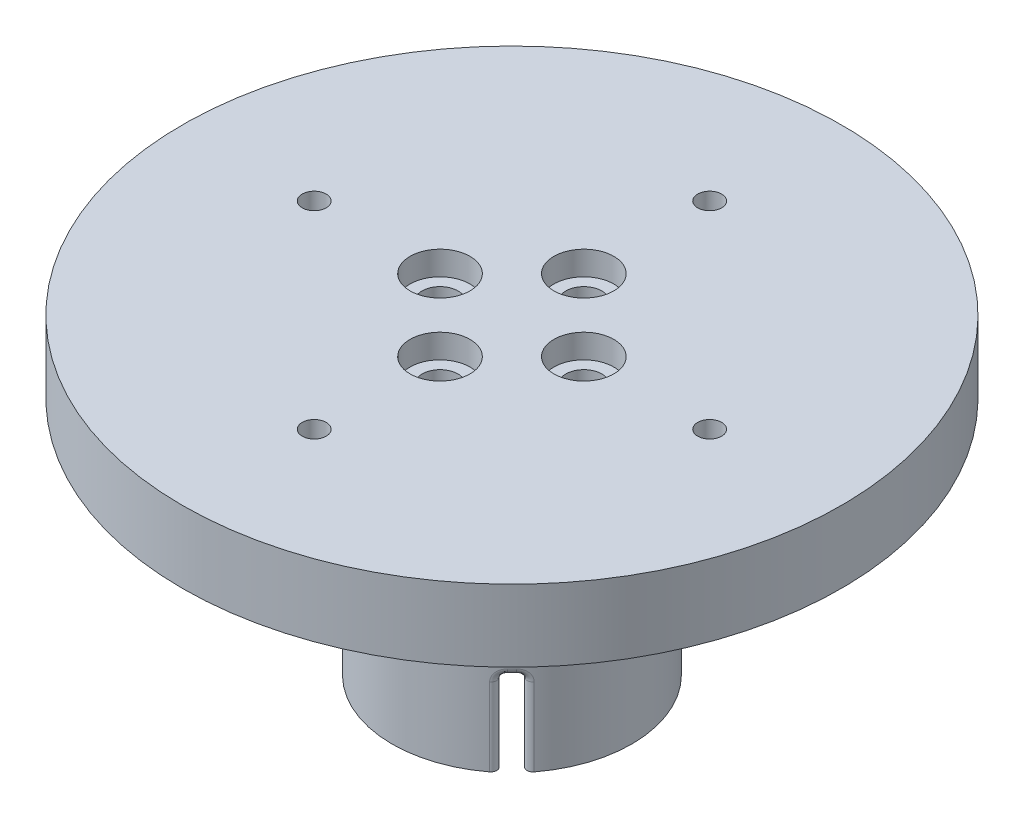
ISO-10303-21;
HEADER;
FILE_DESCRIPTION(('STEP AP214'),'2;1');
FILE_NAME('part.step','',(''),(''),'','','');
FILE_SCHEMA(('AUTOMOTIVE_DESIGN { 1 0 10303 214 1 1 1 1 }'));
ENDSEC;
DATA;
#1=APPLICATION_CONTEXT('core data for automotive mechanical design processes');
#2=APPLICATION_PROTOCOL_DEFINITION('international standard','automotive_design',2000,#1);
#3=PRODUCT_CONTEXT('',#1,'mechanical');
#4=PRODUCT('Part','Part','',(#3));
#5=PRODUCT_RELATED_PRODUCT_CATEGORY('part','',(#4));
#6=PRODUCT_DEFINITION_FORMATION('','',#4);
#7=PRODUCT_DEFINITION_CONTEXT('part definition',#1,'design');
#8=PRODUCT_DEFINITION('design','',#6,#7);
#9=PRODUCT_DEFINITION_SHAPE('','',#8);
#10=(LENGTH_UNIT() NAMED_UNIT(*) SI_UNIT(.MILLI.,.METRE.));
#11=(NAMED_UNIT(*) PLANE_ANGLE_UNIT() SI_UNIT($,.RADIAN.));
#12=(NAMED_UNIT(*) SI_UNIT($,.STERADIAN.) SOLID_ANGLE_UNIT());
#13=UNCERTAINTY_MEASURE_WITH_UNIT(LENGTH_MEASURE(1.E-05),#10,'distance_accuracy_value','');
#14=(GEOMETRIC_REPRESENTATION_CONTEXT(3) GLOBAL_UNCERTAINTY_ASSIGNED_CONTEXT((#13)) GLOBAL_UNIT_ASSIGNED_CONTEXT((#10,
#11,#12)) REPRESENTATION_CONTEXT('',''));
#15=CARTESIAN_POINT('',(0.,0.,0.));
#16=DIRECTION('',(0.,0.,1.));
#17=DIRECTION('',(1.,0.,0.));
#18=AXIS2_PLACEMENT_3D('',#15,#16,#17);
#19=CARTESIAN_POINT('',(-26.6773001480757,-26.,-35.2864937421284));
#20=DIRECTION('',(0.,1.,0.));
#21=DIRECTION('',(0.,0.,1.));
#22=AXIS2_PLACEMENT_3D('',#19,#20,#21);
#23=CYLINDRICAL_SURFACE('',#22,10.);
#24=CARTESIAN_POINT('',(-33.4549751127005,-19.027866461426,-41.9433809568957));
#25=CARTESIAN_POINT('',(-33.8068541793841,-19.0291653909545,-42.3005294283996));
#26=CARTESIAN_POINT('',(-33.6891866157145,-18.555732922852,-42.4162516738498));
#27=CARTESIAN_POINT('',(-33.4739701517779,-19.0186360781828,-41.9250353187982));
#28=CARTESIAN_POINT('',(-33.8266697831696,-19.0188387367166,-42.279765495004));
#29=CARTESIAN_POINT('',(-33.7288343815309,-18.537272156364,-42.3772874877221));
#30=CARTESIAN_POINT('',(-33.4931905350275,-19.0116682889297,-41.9058075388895));
#31=CARTESIAN_POINT('',(-33.8473487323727,-19.0111807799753,-42.2580719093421));
#32=CARTESIAN_POINT('',(-33.7693022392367,-18.523336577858,-42.336811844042));
#33=CARTESIAN_POINT('',(-33.5314814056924,-19.002353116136,-41.8661372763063));
#34=CARTESIAN_POINT('',(-33.8893683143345,-19.0014053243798,-42.2139257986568));
#35=CARTESIAN_POINT('',(-33.8506405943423,-18.5047062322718,-42.2540214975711));
#36=CARTESIAN_POINT('',(-33.5505520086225,-19.0000017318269,-41.8456958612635));
#37=CARTESIAN_POINT('',(-33.9107476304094,-18.9992711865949,-42.1914327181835));
#38=CARTESIAN_POINT('',(-33.8915107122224,-18.5000034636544,-42.2117084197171));
#39=CARTESIAN_POINT('',(-33.5880798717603,-18.9999982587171,-41.8040007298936));
#40=CARTESIAN_POINT('',(-33.9533995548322,-19.0007338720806,-42.1464757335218));
#41=CARTESIAN_POINT('',(-33.9727100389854,-18.4999965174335,-42.1261224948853));
#42=CARTESIAN_POINT('',(-33.6065332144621,-19.0023718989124,-41.7827431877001));
#43=CARTESIAN_POINT('',(-33.9747136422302,-19.0043720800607,-42.1239675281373));
#44=CARTESIAN_POINT('',(-34.0130350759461,-18.5047437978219,-42.0828456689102));
#45=CARTESIAN_POINT('',(-33.6422200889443,-19.0117851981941,-41.7401670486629));
#46=CARTESIAN_POINT('',(-34.0162188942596,-19.0171282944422,-42.0800980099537));
#47=CARTESIAN_POINT('',(-34.0917912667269,-18.5235703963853,-41.9968376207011));
#48=CARTESIAN_POINT('',(-33.6594538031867,-19.018824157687,-41.7188484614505));
#49=CARTESIAN_POINT('',(-34.0364455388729,-19.0262764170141,-42.0586990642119));
#50=CARTESIAN_POINT('',(-34.1302227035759,-18.5376483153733,-41.9541063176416));
#51=CARTESIAN_POINT('',(-33.6922900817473,-19.0373519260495,-41.6768506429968));
#52=CARTESIAN_POINT('',(-34.0750070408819,-19.0494084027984,-42.0179444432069));
#53=CARTESIAN_POINT('',(-34.2041735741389,-18.5747038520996,-41.870511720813));
#54=CARTESIAN_POINT('',(-33.7078940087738,-19.0488369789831,-41.6561708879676));
#55=CARTESIAN_POINT('',(-34.0933638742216,-19.0634314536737,-41.9985657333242));
#56=CARTESIAN_POINT('',(-34.2396954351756,-18.597673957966,-41.8296468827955));
#57=CARTESIAN_POINT('',(-33.7372062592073,-19.0759459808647,-41.6161116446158));
#58=CARTESIAN_POINT('',(-34.1276620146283,-19.0954238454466,-41.9624974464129));
#59=CARTESIAN_POINT('',(-34.3070617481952,-18.6518919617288,-41.7509679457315));
#60=CARTESIAN_POINT('',(-33.7509119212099,-19.0915756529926,-41.5967340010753));
#61=CARTESIAN_POINT('',(-34.1436017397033,-19.113441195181,-41.9458107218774));
#62=CARTESIAN_POINT('',(-34.3389010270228,-18.6831513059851,-41.7131581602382));
#63=CARTESIAN_POINT('',(-33.7762326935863,-19.126592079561,-41.5599446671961));
#64=CARTESIAN_POINT('',(-34.1727394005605,-19.1524157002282,-41.9155294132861));
#65=CARTESIAN_POINT('',(-34.398244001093,-18.7531841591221,-41.6417430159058));
#66=CARTESIAN_POINT('',(-33.7878400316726,-19.1459922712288,-41.5425403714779));
#67=CARTESIAN_POINT('',(-34.185911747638,-19.1734118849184,-41.9019641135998));
#68=CARTESIAN_POINT('',(-34.4257315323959,-18.7919845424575,-41.6081534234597));
#69=CARTESIAN_POINT('',(-33.8087572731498,-19.1879717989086,-41.5104476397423));
#70=CARTESIAN_POINT('',(-34.2093106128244,-19.2172160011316,-41.8781262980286));
#71=CARTESIAN_POINT('',(-34.4756496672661,-18.8759435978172,-41.5464716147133));
#72=CARTESIAN_POINT('',(-33.8180672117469,-19.2105510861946,-41.4957591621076));
#73=CARTESIAN_POINT('',(-34.2195108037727,-19.2400295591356,-41.8678827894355));
#74=CARTESIAN_POINT('',(-34.4980803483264,-18.9211021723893,-41.5183793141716));
#75=CARTESIAN_POINT('',(-33.8343131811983,-19.2583011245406,-41.4696679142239));
#76=CARTESIAN_POINT('',(-34.2370374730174,-19.2865994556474,-41.8505117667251));
#77=CARTESIAN_POINT('',(-34.5374641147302,-19.0166022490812,-41.4686320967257));
#78=CARTESIAN_POINT('',(-33.8412450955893,-19.283476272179,-41.4582708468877));
#79=CARTESIAN_POINT('',(-34.2443290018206,-19.3103365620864,-41.8434211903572));
#80=CARTESIAN_POINT('',(-34.5544076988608,-19.0669525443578,-41.4469883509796));
#81=CARTESIAN_POINT('',(-33.8526511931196,-19.3356367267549,-41.4392934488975));
#82=CARTESIAN_POINT('',(-34.2561749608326,-19.3580697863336,-41.8320463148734));
#83=CARTESIAN_POINT('',(-34.5824054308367,-19.1712734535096,-41.4110208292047));
#84=CARTESIAN_POINT('',(-33.8571288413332,-19.3626194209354,-41.4317077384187));
#85=CARTESIAN_POINT('',(-34.2607076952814,-19.3820231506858,-41.8277835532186));
#86=CARTESIAN_POINT('',(-34.5934678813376,-19.2252388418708,-41.3966867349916));
#87=CARTESIAN_POINT('',(-33.8635935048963,-19.4174851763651,-41.4206964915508));
#88=CARTESIAN_POINT('',(-34.2672152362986,-19.4298162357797,-41.8217091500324));
#89=CARTESIAN_POINT('',(-34.6094706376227,-19.3349703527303,-41.3758981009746));
#90=CARTESIAN_POINT('',(-33.8655955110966,-19.445361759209,-41.4172459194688));
#91=CARTESIAN_POINT('',(-34.2691896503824,-19.4536004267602,-41.8198976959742));
#92=CARTESIAN_POINT('',(-34.6144477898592,-19.3907235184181,-41.3693961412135));
#93=CARTESIAN_POINT('',(-33.8671482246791,-19.5013784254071,-41.4145718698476));
#94=CARTESIAN_POINT('',(-34.2707270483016,-19.5012050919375,-41.8184849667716));
#95=CARTESIAN_POINT('',(-34.6183068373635,-19.5027568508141,-41.3643567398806));
#96=CARTESIAN_POINT('',(-33.8666984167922,-19.5295185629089,-41.4153492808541));
#97=CARTESIAN_POINT('',(-34.2702855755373,-19.524964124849,-41.8188877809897));
#98=CARTESIAN_POINT('',(-34.6171874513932,-19.5590371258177,-41.3658209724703));
#99=CARTESIAN_POINT('',(-33.863358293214,-19.5850670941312,-41.4210891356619));
#100=CARTESIAN_POINT('',(-34.2669671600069,-19.5724546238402,-41.8219475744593));
#101=CARTESIAN_POINT('',(-34.6088925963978,-19.6701341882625,-41.3766418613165));
#102=CARTESIAN_POINT('',(-33.8604834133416,-19.6124789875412,-41.4260251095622));
#103=CARTESIAN_POINT('',(-34.2641139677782,-19.596125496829,-41.8245825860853));
#104=CARTESIAN_POINT('',(-34.6017554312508,-19.7249579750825,-41.3859485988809));
#105=CARTESIAN_POINT('',(-33.8523306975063,-19.6660094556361,-41.4398027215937));
#106=CARTESIAN_POINT('',(-34.2558158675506,-19.6434358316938,-41.8324049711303));
#107=CARTESIAN_POINT('',(-34.5816313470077,-19.8320189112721,-41.4119936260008));
#108=CARTESIAN_POINT('',(-33.847051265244,-19.6921271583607,-41.4486469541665));
#109=CARTESIAN_POINT('',(-34.2503883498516,-19.6670257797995,-41.837575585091));
#110=CARTESIAN_POINT('',(-34.5686405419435,-19.8842543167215,-41.4287368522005));
#111=CARTESIAN_POINT('',(-33.8405801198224,-19.7172064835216,-41.4593194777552));
#112=CARTESIAN_POINT('',(-34.2435798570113,-19.6906068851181,-41.8441763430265));
#113=CARTESIAN_POINT('',(-34.5528058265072,-19.9344129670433,-41.4489940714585));
#114=(BOUNDED_SURFACE() B_SPLINE_SURFACE(3,2,((#24,#25,#26),(#27,#28,#29),(#30,#31,#32),(#33,
#34,#35),(#36,#37,#38),(#39,#40,#41),(#42,#43,#44),(#45,#46,#47),(#48,#49,#50),(#51,#52,#53),
(#54,#55,#56),(#57,#58,#59),(#60,#61,#62),(#63,#64,#65),(#66,#67,#68),(#69,#70,#71),(#72,#73,
#74),(#75,#76,#77),(#78,#79,#80),(#81,#82,#83),(#84,#85,#86),(#87,#88,#89),(#90,#91,#92),(#93,
#94,#95),(#96,#97,#98),(#99,#100,#101),(#102,#103,#104),(#105,#106,#107),(#108,#109,#110),(#111,
#112,#113)),.UNSPECIFIED.,.F.,.F.,.F.) B_SPLINE_SURFACE_WITH_KNOTS((4,2,2,2,2,2,2,2,2,2,2,2,2,2,
4),(3,3),(0.,0.167606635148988,0.335067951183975,0.503443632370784,0.67179407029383,
0.840002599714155,1.00844462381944,1.17749832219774,1.34654942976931,1.51589171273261,
1.68499428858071,1.8530677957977,2.02117662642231,2.18822343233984,2.35538129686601),(0.,1.),
.UNSPECIFIED.) GEOMETRIC_REPRESENTATION_ITEM() RATIONAL_B_SPLINE_SURFACE(((1.,0.706136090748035,
1.),(1.,0.706952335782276,1.),(1.,0.70745465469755,1.),(1.,0.707791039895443,1.),(1.,
0.707625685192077,1.),(1.,0.706585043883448,1.),(1.,0.705705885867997,1.),(1.,0.70328541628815,
1.),(1.,0.701744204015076,1.),(1.,0.698119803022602,1.),(1.,0.696037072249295,1.),(1.,
0.69150693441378,1.),(1.,0.689059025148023,1.),(1.,0.68401968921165,1.),(1.,0.681427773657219,
1.),(1.,0.676366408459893,1.),(1.,0.673896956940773,1.),(1.,0.669335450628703,1.),(1.,
0.667244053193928,1.),(1.,0.663677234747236,1.),(1.,0.662200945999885,1.),(1.,0.660035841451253,
1.),(1.,0.659342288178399,1.),(1.,0.65880564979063,1.),(1.,0.658962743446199,1.),(1.,
0.660110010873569,1.),(1.,0.66109491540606,1.),(1.,0.663764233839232,1.),(1.,0.66544911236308,
1.),(1.,0.667419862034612,1.))) REPRESENTATION_ITEM('') SURFACE());
#115=CARTESIAN_POINT('',(-34.5528058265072,-19.9344129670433,-41.4489940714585));
#116=CARTESIAN_POINT('',(-34.5686405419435,-19.8842543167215,-41.4287368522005));
#117=CARTESIAN_POINT('',(-34.5816313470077,-19.8320189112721,-41.4119936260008));
#118=CARTESIAN_POINT('',(-34.6017554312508,-19.7249579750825,-41.3859485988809));
#119=CARTESIAN_POINT('',(-34.6088925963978,-19.6701341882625,-41.3766418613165));
#120=CARTESIAN_POINT('',(-34.6171874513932,-19.5590371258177,-41.3658209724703));
#121=CARTESIAN_POINT('',(-34.6183068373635,-19.5027568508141,-41.3643567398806));
#122=CARTESIAN_POINT('',(-34.6144477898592,-19.3907235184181,-41.3693961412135));
#123=CARTESIAN_POINT('',(-34.6094706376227,-19.3349703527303,-41.3758981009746));
#124=CARTESIAN_POINT('',(-34.5934678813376,-19.2252388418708,-41.3966867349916));
#125=CARTESIAN_POINT('',(-34.5824054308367,-19.1712734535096,-41.4110208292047));
#126=CARTESIAN_POINT('',(-34.5544076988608,-19.0669525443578,-41.4469883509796));
#127=CARTESIAN_POINT('',(-34.5374641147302,-19.0166022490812,-41.4686320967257));
#128=CARTESIAN_POINT('',(-34.4980803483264,-18.9211021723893,-41.5183793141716));
#129=CARTESIAN_POINT('',(-34.4756496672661,-18.8759435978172,-41.5464716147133));
#130=CARTESIAN_POINT('',(-34.4257315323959,-18.7919845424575,-41.6081534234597));
#131=CARTESIAN_POINT('',(-34.398244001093,-18.7531841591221,-41.6417430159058));
#132=CARTESIAN_POINT('',(-34.3389010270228,-18.6831513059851,-41.7131581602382));
#133=CARTESIAN_POINT('',(-34.3070617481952,-18.6518919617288,-41.7509679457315));
#134=CARTESIAN_POINT('',(-34.2396954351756,-18.597673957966,-41.8296468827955));
#135=CARTESIAN_POINT('',(-34.2041735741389,-18.5747038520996,-41.870511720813));
#136=CARTESIAN_POINT('',(-34.1302227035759,-18.5376483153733,-41.9541063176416));
#137=CARTESIAN_POINT('',(-34.0917912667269,-18.5235703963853,-41.9968376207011));
#138=CARTESIAN_POINT('',(-34.0130350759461,-18.5047437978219,-42.0828456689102));
#139=CARTESIAN_POINT('',(-33.9727100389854,-18.4999965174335,-42.1261224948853));
#140=CARTESIAN_POINT('',(-33.8915107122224,-18.5000034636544,-42.2117084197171));
#141=CARTESIAN_POINT('',(-33.8506405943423,-18.5047062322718,-42.2540214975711));
#142=CARTESIAN_POINT('',(-33.7693022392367,-18.523336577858,-42.336811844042));
#143=CARTESIAN_POINT('',(-33.7288343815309,-18.537272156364,-42.3772874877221));
#144=CARTESIAN_POINT('',(-33.6891866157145,-18.555732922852,-42.4162516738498));
#145=B_SPLINE_CURVE_WITH_KNOTS('',3,(#115,#116,#117,#118,#119,#120,#121,#122,#123,#124,#125,
#126,#127,#128,#129,#130,#131,#132,#133,#134,#135,#136,#137,#138,#139,#140,#141,#142,#143,#144),
.UNSPECIFIED.,.F.,.F.,(4,2,2,2,2,2,2,2,2,2,2,2,2,2,4),(0.,0.167157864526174,0.3342046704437,
0.502313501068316,0.670387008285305,0.8394895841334,1.0088318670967,1.17788297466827,
1.34693667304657,1.51537869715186,1.68358722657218,1.85193766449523,2.02031334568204,
2.18777466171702,2.35538129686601),.UNSPECIFIED.);
#146=CARTESIAN_POINT('',(-34.6172935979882,-19.5,-41.3656798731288));
#147=VERTEX_POINT('',#146);
#148=CARTESIAN_POINT('',(-33.9319998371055,-18.5,-42.1690319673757));
#149=VERTEX_POINT('',#148);
#150=EDGE_CURVE('E496',#147,#149,#145,.T.);
#151=ORIENTED_EDGE('',*,*,#150,.F.);
#152=DIRECTION('',(0.,1.,0.));
#153=VECTOR('',#152,1.);
#154=CARTESIAN_POINT('',(-34.6172935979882,-26.,-41.3656798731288));
#155=LINE('',#154,#153);
#156=CARTESIAN_POINT('',(-34.6172935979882,-26.,-41.3656798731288));
#157=VERTEX_POINT('',#156);
#158=EDGE_CURVE('E157',#147,#157,#155,.F.);
#159=ORIENTED_EDGE('',*,*,#158,.T.);
#160=CARTESIAN_POINT('',(-26.6773001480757,-26.,-35.2864937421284));
#161=DIRECTION('',(0.,-1.,0.));
#162=DIRECTION('',(0.,0.,-1.));
#163=AXIS2_PLACEMENT_3D('',#160,#161,#162);
#164=CIRCLE('',#163,10.);
#165=CARTESIAN_POINT('',(-20.5981140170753,-26.,-27.346500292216));
#166=VERTEX_POINT('',#165);
#167=EDGE_CURVE('E150',#166,#157,#164,.T.);
#168=ORIENTED_EDGE('',*,*,#167,.F.);
#169=DIRECTION('',(0.,1.,0.));
#170=VECTOR('',#169,1.);
#171=CARTESIAN_POINT('',(-20.5981140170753,-26.,-27.346500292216));
#172=LINE('',#171,#170);
#173=CARTESIAN_POINT('',(-20.5981140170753,-19.5,-27.346500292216));
#174=VERTEX_POINT('',#173);
#175=EDGE_CURVE('E494',#166,#174,#172,.T.);
#176=ORIENTED_EDGE('',*,*,#175,.T.);
#177=CARTESIAN_POINT('',(-20.5238520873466,-19.6641070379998,-28.1115568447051));
#178=CARTESIAN_POINT('',(-20.1312618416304,-19.6419866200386,-27.7080969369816));
#179=CARTESIAN_POINT('',(-20.5515313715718,-19.8282140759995,-27.382383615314));
#180=CARTESIAN_POINT('',(-20.5319893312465,-19.637792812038,-28.1067269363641));
#181=CARTESIAN_POINT('',(-20.1359392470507,-19.6182444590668,-27.7031569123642));
#182=CARTESIAN_POINT('',(-20.5669217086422,-19.775585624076,-27.3704746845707));
#183=CARTESIAN_POINT('',(-20.5381568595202,-19.6106927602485,-28.1031001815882));
#184=CARTESIAN_POINT('',(-20.1393584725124,-19.5945974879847,-27.6995008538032));
#185=CARTESIAN_POINT('',(-20.5785687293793,-19.721385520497,-27.3615021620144));
#186=CARTESIAN_POINT('',(-20.5464194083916,-19.5557283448,-28.0982644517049));
#187=CARTESIAN_POINT('',(-20.1438637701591,-19.5472713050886,-27.6946519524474));
#188=CARTESIAN_POINT('',(-20.5941599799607,-19.6114566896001,-27.3495180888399));
#189=CARTESIAN_POINT('',(-20.548517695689,-19.527864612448,-28.09705353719));
#190=CARTESIAN_POINT('',(-20.144940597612,-19.5236481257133,-27.6934689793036));
#191=CARTESIAN_POINT('',(-20.5981103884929,-19.5557292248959,-27.3465017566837));
#192=CARTESIAN_POINT('',(-20.5485221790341,-19.4720275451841,-28.0970531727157));
#193=CARTESIAN_POINT('',(-20.1449343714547,-19.476260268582,-27.6934728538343));
#194=CARTESIAN_POINT('',(-20.5981176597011,-19.4440550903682,-27.3464988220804));
#195=CARTESIAN_POINT('',(-20.5464121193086,-19.4440542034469,-28.098273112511));
#196=CARTESIAN_POINT('',(-20.1438429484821,-19.4525569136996,-27.6946688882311));
#197=CARTESIAN_POINT('',(-20.5941439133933,-19.3881084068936,-27.3495356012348));
#198=CARTESIAN_POINT('',(-20.5380717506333,-19.3889126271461,-28.1031454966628));
#199=CARTESIAN_POINT('',(-20.1393293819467,-19.405047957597,-27.6995377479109));
#200=CARTESIAN_POINT('',(-20.5784104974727,-19.277825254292,-27.3616185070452));
#201=CARTESIAN_POINT('',(-20.5318422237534,-19.3617442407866,-28.1067974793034));
#202=CARTESIAN_POINT('',(-20.1359189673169,-19.3813001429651,-27.7031980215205));
#203=CARTESIAN_POINT('',(-20.5666523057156,-19.2234884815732,-27.3706634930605));
#204=CARTESIAN_POINT('',(-20.5155397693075,-19.3089973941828,-28.1165080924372));
#205=CARTESIAN_POINT('',(-20.1264397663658,-19.3338997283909,-27.7131694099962));
#206=CARTESIAN_POINT('',(-20.5358007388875,-19.1179947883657,-27.3945762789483));
#207=CARTESIAN_POINT('',(-20.5054701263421,-19.2834175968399,-28.1225646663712));
#208=CARTESIAN_POINT('',(-20.120395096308,-19.3102938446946,-27.7194559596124));
#209=CARTESIAN_POINT('',(-20.5167136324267,-19.0668351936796,-27.4094391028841));
#210=CARTESIAN_POINT('',(-20.4818951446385,-19.2344998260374,-28.1370520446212));
#211=CARTESIAN_POINT('',(-20.1052646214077,-19.2636405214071,-27.7348831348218));
#212=CARTESIAN_POINT('',(-20.471865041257,-18.9689996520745,-27.4447217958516));
#213=CARTESIAN_POINT('',(-20.4683850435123,-19.2111650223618,-28.1454861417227));
#214=CARTESIAN_POINT('',(-20.0962038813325,-19.2406215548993,-27.7439994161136));
#215=CARTESIAN_POINT('',(-20.4460943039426,-18.9223300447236,-27.4651493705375));
#216=CARTESIAN_POINT('',(-20.4384126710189,-19.1673192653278,-28.1646946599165));
#217=CARTESIAN_POINT('',(-20.0747605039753,-19.1959233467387,-27.7652327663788));
#218=CARTESIAN_POINT('',(-20.3886597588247,-18.8346385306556,-27.5112535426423));
#219=CARTESIAN_POINT('',(-20.4219372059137,-19.1468216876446,-28.1754795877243));
#220=CARTESIAN_POINT('',(-20.0623930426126,-19.1742533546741,-27.7773355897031));
#221=CARTESIAN_POINT('',(-20.3569695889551,-18.7936433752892,-27.5369536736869));
#222=CARTESIAN_POINT('',(-20.3867150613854,-19.1093436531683,-28.1992441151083));
#223=CARTESIAN_POINT('',(-20.0343879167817,-19.1334432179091,-27.8044454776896));
#224=CARTESIAN_POINT('',(-20.2888480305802,-18.7186873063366,-27.5930145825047));
#225=CARTESIAN_POINT('',(-20.36796833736,-19.0923632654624,-28.2122237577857));
#226=CARTESIAN_POINT('',(-20.0187724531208,-19.1142816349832,-27.8194329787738));
#227=CARTESIAN_POINT('',(-20.2524165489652,-18.6847265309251,-27.6233754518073));
#228=CARTESIAN_POINT('',(-20.3287812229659,-19.0623065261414,-28.240270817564));
#229=CARTESIAN_POINT('',(-19.9845260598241,-19.0795098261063,-27.8521056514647));
#230=CARTESIAN_POINT('',(-20.1757805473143,-18.6246130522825,-27.6882850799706));
#231=CARTESIAN_POINT('',(-20.3083316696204,-19.0492533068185,-28.2553498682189));
#232=CARTESIAN_POINT('',(-19.9658834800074,-19.0638802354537,-27.8698021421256));
#233=CARTESIAN_POINT('',(-20.1355554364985,-18.5985066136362,-27.7228570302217));
#234=CARTESIAN_POINT('',(-20.2665863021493,-19.0275756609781,-28.2872397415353));
#235=CARTESIAN_POINT('',(-19.92633465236,-19.0373456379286,-27.9072622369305));
#236=CARTESIAN_POINT('',(-20.0528575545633,-18.5551513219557,-27.7951807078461));
#237=CARTESIAN_POINT('',(-20.2452917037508,-19.0189451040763,-28.304048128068));
#238=CARTESIAN_POINT('',(-19.9054170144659,-19.0263888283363,-27.9270371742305));
#239=CARTESIAN_POINT('',(-20.0103879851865,-18.5378902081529,-27.832927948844));
#240=CARTESIAN_POINT('',(-20.2025913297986,-19.0063573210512,-28.3389993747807));
#241=CARTESIAN_POINT('',(-19.8622308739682,-19.0099293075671,-27.9678800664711));
#242=CARTESIAN_POINT('',(-19.9245709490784,-18.5127146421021,-27.9105880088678));
#243=CARTESIAN_POINT('',(-20.1811859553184,-19.0023886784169,-28.3571388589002));
#244=CARTESIAN_POINT('',(-19.8399329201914,-19.0043766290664,-27.9889757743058));
#245=CARTESIAN_POINT('',(-19.8812258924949,-18.5047773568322,-27.9504952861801));
#246=CARTESIAN_POINT('',(-20.1388685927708,-18.9992075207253,-28.3943230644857));
#247=CARTESIAN_POINT('',(-19.7949219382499,-18.9990477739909,-28.0316307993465));
#248=CARTESIAN_POINT('',(-19.7948383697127,-18.498415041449,-28.0314794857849));
#249=CARTESIAN_POINT('',(-20.1179566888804,-18.9999958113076,-28.4133679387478));
#250=CARTESIAN_POINT('',(-19.7721647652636,-18.9992548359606,-28.0532318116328));
#251=CARTESIAN_POINT('',(-19.751795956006,-18.4999916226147,-28.0725566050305));
#252=CARTESIAN_POINT('',(-20.077356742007,-19.0063010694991,-28.4516819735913));
#253=CARTESIAN_POINT('',(-19.7273911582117,-19.005427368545,-28.095808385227));
#254=CARTESIAN_POINT('',(-19.6675254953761,-18.5126021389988,-28.1544208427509));
#255=CARTESIAN_POINT('',(-20.0576618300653,-19.0117882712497,-28.4709489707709));
#256=CARTESIAN_POINT('',(-19.7053265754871,-19.0113618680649,-28.1168292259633));
#257=CARTESIAN_POINT('',(-19.6262877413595,-18.5235765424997,-28.1952081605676));
#258=CARTESIAN_POINT('',(-20.0198109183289,-19.0272753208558,-28.5092150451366));
#259=CARTESIAN_POINT('',(-19.6626124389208,-19.0284663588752,-28.1575550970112));
#260=CARTESIAN_POINT('',(-19.546383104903,-18.5545506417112,-28.2755498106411));
#261=CARTESIAN_POINT('',(-20.001656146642,-19.0372787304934,-28.5282138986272));
#262=CARTESIAN_POINT('',(-19.6419293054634,-19.0396643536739,-28.1772922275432));
#263=CARTESIAN_POINT('',(-19.5077182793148,-18.5745574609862,-28.3151031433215));
#264=CARTESIAN_POINT('',(-19.9845159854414,-19.0494475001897,-28.5467583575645));
#265=CARTESIAN_POINT('',(-19.6224462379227,-19.0532550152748,-28.195878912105));
#266=CARTESIAN_POINT('',(-19.4708946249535,-18.5988950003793,-28.3534050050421));
#267=(BOUNDED_SURFACE() B_SPLINE_SURFACE(3,2,((#177,#178,#179),(#180,#181,#182),(#183,#184,
#185),(#186,#187,#188),(#189,#190,#191),(#192,#193,#194),(#195,#196,#197),(#198,#199,#200),
(#201,#202,#203),(#204,#205,#206),(#207,#208,#209),(#210,#211,#212),(#213,#214,#215),(#216,#217,
#218),(#219,#220,#221),(#222,#223,#224),(#225,#226,#227),(#228,#229,#230),(#231,#232,#233),
(#234,#235,#236),(#237,#238,#239),(#240,#241,#242),(#243,#244,#245),(#246,#247,#248),(#249,#250,
#251),(#252,#253,#254),(#255,#256,#257),(#258,#259,#260),(#261,#262,#263),(#264,#265,#266)),
.UNSPECIFIED.,.F.,.F.,.F.) B_SPLINE_SURFACE_WITH_KNOTS((4,2,2,2,2,2,2,2,2,2,2,2,2,2,4),(3,3),
(0.,0.167126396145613,0.3341185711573,0.501757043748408,0.669363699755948,0.836827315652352,
1.00452401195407,1.17298616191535,1.34145162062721,1.51089079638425,1.68009446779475,
1.84888290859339,2.0176999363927,2.18545541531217,2.35334342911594),(0.,1.),
.UNSPECIFIED.) GEOMETRIC_REPRESENTATION_ITEM() RATIONAL_B_SPLINE_SURFACE(((1.,0.663783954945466,
1.),(1.,0.662216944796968,1.),(1.,0.661007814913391,1.),(1.,0.659373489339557,1.),(1.,
0.658947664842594,1.),(1.,0.658945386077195,1.),(1.,0.659372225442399,1.),(1.,0.661027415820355,
1.),(1.,0.662255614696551,1.),(1.,0.665373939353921,1.),(1.,0.667263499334,1.),(1.,
0.671500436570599,1.),(1.,0.673848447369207,1.),(1.,0.678765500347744,1.),(1.,0.681335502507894,
1.),(1.,0.686428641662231,1.),(1.,0.688951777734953,1.),(1.,0.693724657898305,1.),(1.,
0.695972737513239,1.),(1.,0.69997232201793,1.),(1.,0.701724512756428,1.),(1.,0.704588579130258,
1.),(1.,0.705702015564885,1.),(1.,0.707222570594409,1.),(1.,0.707629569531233,1.),(1.,
0.707734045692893,1.),(1.,0.707435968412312,1.),(1.,0.706226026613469,1.),(1.,0.705313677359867,
1.),(1.,0.704137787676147,1.))) REPRESENTATION_ITEM('') SURFACE());
#268=CARTESIAN_POINT('',(-19.4708946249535,-18.5988950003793,-28.3534050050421));
#269=CARTESIAN_POINT('',(-19.5077182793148,-18.5745574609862,-28.3151031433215));
#270=CARTESIAN_POINT('',(-19.546383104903,-18.5545506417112,-28.2755498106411));
#271=CARTESIAN_POINT('',(-19.6262877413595,-18.5235765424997,-28.1952081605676));
#272=CARTESIAN_POINT('',(-19.6675254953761,-18.5126021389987,-28.1544208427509));
#273=CARTESIAN_POINT('',(-19.751795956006,-18.4999916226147,-28.0725566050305));
#274=CARTESIAN_POINT('',(-19.7948383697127,-18.498415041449,-28.0314794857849));
#275=CARTESIAN_POINT('',(-19.8812258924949,-18.5047773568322,-27.9504952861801));
#276=CARTESIAN_POINT('',(-19.9245709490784,-18.5127146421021,-27.9105880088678));
#277=CARTESIAN_POINT('',(-20.0103879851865,-18.5378902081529,-27.832927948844));
#278=CARTESIAN_POINT('',(-20.0528575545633,-18.5551513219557,-27.7951807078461));
#279=CARTESIAN_POINT('',(-20.1355554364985,-18.5985066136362,-27.7228570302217));
#280=CARTESIAN_POINT('',(-20.1757805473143,-18.6246130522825,-27.6882850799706));
#281=CARTESIAN_POINT('',(-20.2524165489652,-18.6847265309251,-27.6233754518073));
#282=CARTESIAN_POINT('',(-20.2888480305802,-18.7186873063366,-27.5930145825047));
#283=CARTESIAN_POINT('',(-20.3569695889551,-18.7936433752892,-27.5369536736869));
#284=CARTESIAN_POINT('',(-20.3886597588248,-18.8346385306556,-27.5112535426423));
#285=CARTESIAN_POINT('',(-20.4460943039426,-18.9223300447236,-27.4651493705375));
#286=CARTESIAN_POINT('',(-20.471865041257,-18.9689996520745,-27.4447217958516));
#287=CARTESIAN_POINT('',(-20.5167136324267,-19.0668351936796,-27.4094391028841));
#288=CARTESIAN_POINT('',(-20.5358007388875,-19.1179947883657,-27.3945762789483));
#289=CARTESIAN_POINT('',(-20.5666523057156,-19.2234884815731,-27.3706634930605));
#290=CARTESIAN_POINT('',(-20.5784104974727,-19.277825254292,-27.3616185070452));
#291=CARTESIAN_POINT('',(-20.5941439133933,-19.3881084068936,-27.3495356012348));
#292=CARTESIAN_POINT('',(-20.5981176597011,-19.4440550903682,-27.3464988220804));
#293=CARTESIAN_POINT('',(-20.5981103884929,-19.5557292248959,-27.3465017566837));
#294=CARTESIAN_POINT('',(-20.5941599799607,-19.6114566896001,-27.3495180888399));
#295=CARTESIAN_POINT('',(-20.5785687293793,-19.721385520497,-27.3615021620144));
#296=CARTESIAN_POINT('',(-20.5669217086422,-19.775585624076,-27.3704746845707));
#297=CARTESIAN_POINT('',(-20.5515313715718,-19.8282140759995,-27.382383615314));
#298=B_SPLINE_CURVE_WITH_KNOTS('',3,(#268,#269,#270,#271,#272,#273,#274,#275,#276,#277,#278,
#279,#280,#281,#282,#283,#284,#285,#286,#287,#288,#289,#290,#291,#292,#293,#294,#295,#296,#297),
.UNSPECIFIED.,.F.,.F.,(4,2,2,2,2,2,2,2,2,2,2,2,2,2,4),(0.,0.167888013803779,0.335643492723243,
0.504460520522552,0.673248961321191,0.842452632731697,1.01189180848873,1.1803572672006,
1.34881941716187,1.51651611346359,1.68397972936,1.85158638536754,2.01922485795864,
2.18621703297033,2.35334342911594),.UNSPECIFIED.);
#299=CARTESIAN_POINT('',(-19.7947619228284,-18.5,-28.0317940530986));
#300=VERTEX_POINT('',#299);
#301=EDGE_CURVE('E487',#300,#174,#298,.T.);
#302=ORIENTED_EDGE('',*,*,#301,.F.);
#303=CARTESIAN_POINT('',(-26.6773001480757,-18.5,-35.2864937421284));
#304=DIRECTION('',(0.,-1.,0.));
#305=DIRECTION('',(0.,0.,-1.));
#306=AXIS2_PLACEMENT_3D('',#303,#304,#305);
#307=CIRCLE('',#306,10.);
#308=CARTESIAN_POINT('',(-19.422600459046,-18.5,-28.403955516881));
#309=VERTEX_POINT('',#308);
#310=EDGE_CURVE('E478',#300,#309,#307,.F.);
#311=ORIENTED_EDGE('',*,*,#310,.T.);
#312=CARTESIAN_POINT('',(-19.899625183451,-19.027866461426,-28.629606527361));
#313=CARTESIAN_POINT('',(-19.5477461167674,-19.0291653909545,-28.2724580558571));
#314=CARTESIAN_POINT('',(-19.665413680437,-18.555732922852,-28.1567358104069));
#315=CARTESIAN_POINT('',(-19.8806301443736,-19.0186360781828,-28.6479521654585));
#316=CARTESIAN_POINT('',(-19.5279305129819,-19.0188387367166,-28.2932219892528));
#317=CARTESIAN_POINT('',(-19.6257659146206,-18.537272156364,-28.1956999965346));
#318=CARTESIAN_POINT('',(-19.861409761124,-19.0116682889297,-28.6671799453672));
#319=CARTESIAN_POINT('',(-19.5072515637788,-19.0111807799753,-28.3149155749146));
#320=CARTESIAN_POINT('',(-19.5852980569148,-18.5233365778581,-28.2361756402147));
#321=CARTESIAN_POINT('',(-19.8231188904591,-19.002353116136,-28.7068502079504));
#322=CARTESIAN_POINT('',(-19.465231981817,-19.0014053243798,-28.3590616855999));
#323=CARTESIAN_POINT('',(-19.5039597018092,-18.5047062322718,-28.3189659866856));
#324=CARTESIAN_POINT('',(-19.804048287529,-19.0000017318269,-28.7272916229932));
#325=CARTESIAN_POINT('',(-19.4438526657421,-18.9992711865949,-28.3815547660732));
#326=CARTESIAN_POINT('',(-19.4630895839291,-18.5000034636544,-28.3612790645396));
#327=CARTESIAN_POINT('',(-19.7665204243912,-18.9999982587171,-28.7689867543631));
#328=CARTESIAN_POINT('',(-19.4012007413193,-19.0007338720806,-28.4265117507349));
#329=CARTESIAN_POINT('',(-19.3818902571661,-18.4999965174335,-28.4468649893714));
#330=CARTESIAN_POINT('',(-19.7480670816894,-19.0023718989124,-28.7902442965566));
#331=CARTESIAN_POINT('',(-19.3798866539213,-19.0043720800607,-28.4490199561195));
#332=CARTESIAN_POINT('',(-19.3415652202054,-18.5047437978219,-28.4901418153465));
#333=CARTESIAN_POINT('',(-19.7123802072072,-19.0117851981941,-28.8328204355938));
#334=CARTESIAN_POINT('',(-19.3383814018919,-19.0171282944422,-28.492889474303));
#335=CARTESIAN_POINT('',(-19.2628090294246,-18.5235703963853,-28.5761498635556));
#336=CARTESIAN_POINT('',(-19.6951464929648,-19.018824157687,-28.8541390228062));
#337=CARTESIAN_POINT('',(-19.3181547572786,-19.0262764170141,-28.5142884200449));
#338=CARTESIAN_POINT('',(-19.2243775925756,-18.5376483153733,-28.6188811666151));
#339=CARTESIAN_POINT('',(-19.6623102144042,-19.0373519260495,-28.8961368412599));
#340=CARTESIAN_POINT('',(-19.2795932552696,-19.0494084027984,-28.5550430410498));
#341=CARTESIAN_POINT('',(-19.1504267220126,-18.5747038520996,-28.7024757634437));
#342=CARTESIAN_POINT('',(-19.6467062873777,-19.0488369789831,-28.9168165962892));
#343=CARTESIAN_POINT('',(-19.2612364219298,-19.0634314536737,-28.5744217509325));
#344=CARTESIAN_POINT('',(-19.1149048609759,-18.597673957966,-28.7433406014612));
#345=CARTESIAN_POINT('',(-19.6173940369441,-19.0759459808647,-28.956875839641));
#346=CARTESIAN_POINT('',(-19.2269382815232,-19.0954238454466,-28.6104900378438));
#347=CARTESIAN_POINT('',(-19.0475385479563,-18.6518919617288,-28.8220195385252));
#348=CARTESIAN_POINT('',(-19.6036883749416,-19.0915756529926,-28.9762534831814));
#349=CARTESIAN_POINT('',(-19.2109985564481,-19.113441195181,-28.6271767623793));
#350=CARTESIAN_POINT('',(-19.0156992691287,-18.6831513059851,-28.8598293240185));
#351=CARTESIAN_POINT('',(-19.5783676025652,-19.126592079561,-29.0130428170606));
#352=CARTESIAN_POINT('',(-19.181860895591,-19.1524157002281,-28.6574580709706));
#353=CARTESIAN_POINT('',(-18.9563562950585,-18.7531841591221,-28.9312444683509));
#354=CARTESIAN_POINT('',(-19.5667602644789,-19.1459922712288,-29.0304471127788));
#355=CARTESIAN_POINT('',(-19.1686885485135,-19.1734118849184,-28.6710233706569));
#356=CARTESIAN_POINT('',(-18.9288687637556,-18.7919845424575,-28.964834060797));
#357=CARTESIAN_POINT('',(-19.5458430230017,-19.1879717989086,-29.0625398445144));
#358=CARTESIAN_POINT('',(-19.1452896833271,-19.2172160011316,-28.6948611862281));
#359=CARTESIAN_POINT('',(-18.8789506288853,-18.8759435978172,-29.0265158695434));
#360=CARTESIAN_POINT('',(-19.5365330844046,-19.2105510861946,-29.0772283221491));
#361=CARTESIAN_POINT('',(-19.1350894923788,-19.2400295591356,-28.7051046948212));
#362=CARTESIAN_POINT('',(-18.8565199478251,-18.9211021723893,-29.0546081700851));
#363=CARTESIAN_POINT('',(-19.5202871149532,-19.2583011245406,-29.1033195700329));
#364=CARTESIAN_POINT('',(-19.1175628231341,-19.2865994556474,-28.7224757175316));
#365=CARTESIAN_POINT('',(-18.8171361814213,-19.0166022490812,-29.104355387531));
#366=CARTESIAN_POINT('',(-19.5133552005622,-19.283476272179,-29.114716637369));
#367=CARTESIAN_POINT('',(-19.1102712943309,-19.3103365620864,-28.7295662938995));
#368=CARTESIAN_POINT('',(-18.8001925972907,-19.0669525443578,-29.1259991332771));
#369=CARTESIAN_POINT('',(-19.5019491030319,-19.3356367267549,-29.1336940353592));
#370=CARTESIAN_POINT('',(-19.0984253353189,-19.3580697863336,-28.7409411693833));
#371=CARTESIAN_POINT('',(-18.7721948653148,-19.1712734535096,-29.161966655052));
#372=CARTESIAN_POINT('',(-19.4974714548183,-19.3626194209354,-29.1412797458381));
#373=CARTESIAN_POINT('',(-19.0938926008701,-19.3820231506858,-28.7452039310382));
#374=CARTESIAN_POINT('',(-18.7611324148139,-19.2252388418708,-29.1763007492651));
#375=CARTESIAN_POINT('',(-19.4910067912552,-19.4174851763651,-29.1522909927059));
#376=CARTESIAN_POINT('',(-19.0873850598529,-19.4298162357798,-28.7512783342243));
#377=CARTESIAN_POINT('',(-18.7451296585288,-19.3349703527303,-29.197089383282));
#378=CARTESIAN_POINT('',(-19.4890047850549,-19.445361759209,-29.1557415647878));
#379=CARTESIAN_POINT('',(-19.0854106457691,-19.4536004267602,-28.7530897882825));
#380=CARTESIAN_POINT('',(-18.7401525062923,-19.3907235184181,-29.2035913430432));
#381=CARTESIAN_POINT('',(-19.4874520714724,-19.5013784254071,-29.1584156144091));
#382=CARTESIAN_POINT('',(-19.0838732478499,-19.5012050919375,-28.7545025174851));
#383=CARTESIAN_POINT('',(-18.736293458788,-19.5027568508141,-29.2086307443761));
#384=CARTESIAN_POINT('',(-19.4879018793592,-19.5295185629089,-29.1576382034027));
#385=CARTESIAN_POINT('',(-19.0843147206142,-19.524964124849,-28.754099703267));
#386=CARTESIAN_POINT('',(-18.7374128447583,-19.5590371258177,-29.2071665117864));
#387=CARTESIAN_POINT('',(-19.4912420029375,-19.5850670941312,-29.1518983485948));
#388=CARTESIAN_POINT('',(-19.0876331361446,-19.5724546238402,-28.7510399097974));
#389=CARTESIAN_POINT('',(-18.7457076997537,-19.6701341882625,-29.1963456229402));
#390=CARTESIAN_POINT('',(-19.4941168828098,-19.6124789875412,-29.1469623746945));
#391=CARTESIAN_POINT('',(-19.0904863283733,-19.596125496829,-28.7484048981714));
#392=CARTESIAN_POINT('',(-18.7528448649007,-19.7249579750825,-29.1870388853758));
#393=CARTESIAN_POINT('',(-19.5022695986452,-19.6660094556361,-29.133184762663));
#394=CARTESIAN_POINT('',(-19.0987844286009,-19.6434358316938,-28.7405825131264));
#395=CARTESIAN_POINT('',(-18.7729689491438,-19.8320189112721,-29.1609938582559));
#396=CARTESIAN_POINT('',(-19.5075490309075,-19.6921271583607,-29.1243405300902));
#397=CARTESIAN_POINT('',(-19.1042119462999,-19.6670257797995,-28.7354118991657));
#398=CARTESIAN_POINT('',(-18.785959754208,-19.8842543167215,-29.1442506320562));
#399=CARTESIAN_POINT('',(-19.5140201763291,-19.7172064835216,-29.1136680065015));
#400=CARTESIAN_POINT('',(-19.1110204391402,-19.6906068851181,-28.7288111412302));
#401=CARTESIAN_POINT('',(-18.8017944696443,-19.9344129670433,-29.1239934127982));
#402=(BOUNDED_SURFACE() B_SPLINE_SURFACE(3,2,((#312,#313,#314),(#315,#316,#317),(#318,#319,
#320),(#321,#322,#323),(#324,#325,#326),(#327,#328,#329),(#330,#331,#332),(#333,#334,#335),
(#336,#337,#338),(#339,#340,#341),(#342,#343,#344),(#345,#346,#347),(#348,#349,#350),(#351,#352,
#353),(#354,#355,#356),(#357,#358,#359),(#360,#361,#362),(#363,#364,#365),(#366,#367,#368),
(#369,#370,#371),(#372,#373,#374),(#375,#376,#377),(#378,#379,#380),(#381,#382,#383),(#384,#385,
#386),(#387,#388,#389),(#390,#391,#392),(#393,#394,#395),(#396,#397,#398),(#399,#400,#401)),
.UNSPECIFIED.,.F.,.F.,.F.) B_SPLINE_SURFACE_WITH_KNOTS((4,2,2,2,2,2,2,2,2,2,2,2,2,2,4),(3,3),
(0.,0.167606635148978,0.33506795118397,0.503443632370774,0.671794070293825,0.840002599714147,
1.00844462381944,1.17749832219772,1.34654942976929,1.51589171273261,1.68499428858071,
1.8530677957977,2.02117662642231,2.18822343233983,2.35538129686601),(0.,1.),
.UNSPECIFIED.) GEOMETRIC_REPRESENTATION_ITEM() RATIONAL_B_SPLINE_SURFACE(((1.,0.706136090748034,
1.),(1.,0.706952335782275,1.),(1.,0.707454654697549,1.),(1.,0.707791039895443,1.),(1.,
0.707625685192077,1.),(1.,0.706585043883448,1.),(1.,0.705705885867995,1.),(1.,0.703285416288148,
1.),(1.,0.701744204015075,1.),(1.,0.698119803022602,1.),(1.,0.696037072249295,1.),(1.,
0.691506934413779,1.),(1.,0.689059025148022,1.),(1.,0.684019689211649,1.),(1.,0.681427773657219,
1.),(1.,0.676366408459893,1.),(1.,0.673896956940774,1.),(1.,0.669335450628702,1.),(1.,
0.667244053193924,1.),(1.,0.663677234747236,1.),(1.,0.662200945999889,1.),(1.,0.660035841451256,
1.),(1.,0.659342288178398,1.),(1.,0.658805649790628,1.),(1.,0.6589627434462,1.),(1.,
0.660110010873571,1.),(1.,0.66109491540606,1.),(1.,0.663764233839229,1.),(1.,0.665449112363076,
1.),(1.,0.667419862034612,1.))) REPRESENTATION_ITEM('') SURFACE());
#403=CARTESIAN_POINT('',(-18.8017944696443,-19.9344129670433,-29.1239934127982));
#404=CARTESIAN_POINT('',(-18.785959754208,-19.8842543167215,-29.1442506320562));
#405=CARTESIAN_POINT('',(-18.7729689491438,-19.8320189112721,-29.1609938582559));
#406=CARTESIAN_POINT('',(-18.7528448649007,-19.7249579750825,-29.1870388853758));
#407=CARTESIAN_POINT('',(-18.7457076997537,-19.6701341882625,-29.1963456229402));
#408=CARTESIAN_POINT('',(-18.7374128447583,-19.5590371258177,-29.2071665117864));
#409=CARTESIAN_POINT('',(-18.736293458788,-19.5027568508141,-29.2086307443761));
#410=CARTESIAN_POINT('',(-18.7401525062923,-19.3907235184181,-29.2035913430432));
#411=CARTESIAN_POINT('',(-18.7451296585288,-19.3349703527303,-29.197089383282));
#412=CARTESIAN_POINT('',(-18.7611324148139,-19.2252388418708,-29.1763007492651));
#413=CARTESIAN_POINT('',(-18.7721948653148,-19.1712734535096,-29.161966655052));
#414=CARTESIAN_POINT('',(-18.8001925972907,-19.0669525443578,-29.1259991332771));
#415=CARTESIAN_POINT('',(-18.8171361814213,-19.0166022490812,-29.104355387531));
#416=CARTESIAN_POINT('',(-18.8565199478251,-18.9211021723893,-29.0546081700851));
#417=CARTESIAN_POINT('',(-18.8789506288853,-18.8759435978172,-29.0265158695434));
#418=CARTESIAN_POINT('',(-18.9288687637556,-18.7919845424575,-28.964834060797));
#419=CARTESIAN_POINT('',(-18.9563562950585,-18.7531841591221,-28.9312444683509));
#420=CARTESIAN_POINT('',(-19.0156992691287,-18.6831513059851,-28.8598293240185));
#421=CARTESIAN_POINT('',(-19.0475385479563,-18.6518919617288,-28.8220195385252));
#422=CARTESIAN_POINT('',(-19.1149048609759,-18.597673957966,-28.7433406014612));
#423=CARTESIAN_POINT('',(-19.1504267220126,-18.5747038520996,-28.7024757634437));
#424=CARTESIAN_POINT('',(-19.2243775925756,-18.5376483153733,-28.6188811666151));
#425=CARTESIAN_POINT('',(-19.2628090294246,-18.5235703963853,-28.5761498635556));
#426=CARTESIAN_POINT('',(-19.3415652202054,-18.5047437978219,-28.4901418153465));
#427=CARTESIAN_POINT('',(-19.3818902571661,-18.4999965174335,-28.4468649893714));
#428=CARTESIAN_POINT('',(-19.4630895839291,-18.5000034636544,-28.3612790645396));
#429=CARTESIAN_POINT('',(-19.5039597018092,-18.5047062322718,-28.3189659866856));
#430=CARTESIAN_POINT('',(-19.5852980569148,-18.5233365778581,-28.2361756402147));
#431=CARTESIAN_POINT('',(-19.6257659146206,-18.537272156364,-28.1956999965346));
#432=CARTESIAN_POINT('',(-19.665413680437,-18.555732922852,-28.1567358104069));
#433=B_SPLINE_CURVE_WITH_KNOTS('',3,(#403,#404,#405,#406,#407,#408,#409,#410,#411,#412,#413,
#414,#415,#416,#417,#418,#419,#420,#421,#422,#423,#424,#425,#426,#427,#428,#429,#430,#431,#432),
.UNSPECIFIED.,.F.,.F.,(4,2,2,2,2,2,2,2,2,2,2,2,2,2,4),(0.,0.167157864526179,0.3342046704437,
0.502313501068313,0.670387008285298,0.8394895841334,1.00883186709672,1.17788297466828,
1.34693667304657,1.51537869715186,1.68358722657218,1.85193766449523,2.02031334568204,
2.18777466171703,2.35538129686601),.UNSPECIFIED.);
#434=CARTESIAN_POINT('',(-18.7373066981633,-19.5,-29.2073076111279));
#435=VERTEX_POINT('',#434);
#436=EDGE_CURVE('E470',#435,#309,#433,.T.);
#437=ORIENTED_EDGE('',*,*,#436,.F.);
#438=DIRECTION('',(0.,1.,0.));
#439=VECTOR('',#438,1.);
#440=CARTESIAN_POINT('',(-18.7373066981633,-26.,-29.2073076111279));
#441=LINE('',#440,#439);
#442=CARTESIAN_POINT('',(-18.7373066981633,-26.,-29.2073076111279));
#443=VERTEX_POINT('',#442);
#444=EDGE_CURVE('E149',#435,#443,#441,.F.);
#445=ORIENTED_EDGE('',*,*,#444,.T.);
#446=CARTESIAN_POINT('',(-32.7564862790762,-26.,-43.2264871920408));
#447=VERTEX_POINT('',#446);
#448=EDGE_CURVE('E134',#447,#443,#164,.T.);
#449=ORIENTED_EDGE('',*,*,#448,.F.);
#450=DIRECTION('',(0.,1.,0.));
#451=VECTOR('',#450,1.);
#452=CARTESIAN_POINT('',(-32.7564862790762,-26.,-43.2264871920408));
#453=LINE('',#452,#451);
#454=CARTESIAN_POINT('',(-32.7564862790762,-19.5,-43.2264871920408));
#455=VERTEX_POINT('',#454);
#456=EDGE_CURVE('E146',#447,#455,#453,.T.);
#457=ORIENTED_EDGE('',*,*,#456,.T.);
#458=CARTESIAN_POINT('',(-32.8307482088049,-19.6641070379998,-42.4614306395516));
#459=CARTESIAN_POINT('',(-33.2233384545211,-19.6419866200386,-42.8648905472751));
#460=CARTESIAN_POINT('',(-32.8030689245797,-19.8282140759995,-43.1906038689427));
#461=CARTESIAN_POINT('',(-32.822610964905,-19.637792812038,-42.4662605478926));
#462=CARTESIAN_POINT('',(-33.2186610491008,-19.6182444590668,-42.8698305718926));
#463=CARTESIAN_POINT('',(-32.7876785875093,-19.775585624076,-43.202512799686));
#464=CARTESIAN_POINT('',(-32.8164434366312,-19.6106927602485,-42.4698873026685));
#465=CARTESIAN_POINT('',(-33.2152418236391,-19.5945974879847,-42.8734866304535));
#466=CARTESIAN_POINT('',(-32.7760315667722,-19.721385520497,-43.2114853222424));
#467=CARTESIAN_POINT('',(-32.8081808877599,-19.5557283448,-42.4747230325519));
#468=CARTESIAN_POINT('',(-33.2107365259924,-19.5472713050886,-42.8783355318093));
#469=CARTESIAN_POINT('',(-32.7604403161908,-19.6114566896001,-43.2234693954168));
#470=CARTESIAN_POINT('',(-32.8060826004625,-19.527864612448,-42.4759339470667));
#471=CARTESIAN_POINT('',(-33.2096596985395,-19.5236481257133,-42.8795185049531));
#472=CARTESIAN_POINT('',(-32.7564899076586,-19.5557292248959,-43.226485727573));
#473=CARTESIAN_POINT('',(-32.8060781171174,-19.4720275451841,-42.475934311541));
#474=CARTESIAN_POINT('',(-33.2096659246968,-19.476260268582,-42.8795146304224));
#475=CARTESIAN_POINT('',(-32.7564826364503,-19.4440550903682,-43.2264886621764));
#476=CARTESIAN_POINT('',(-32.8081881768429,-19.4440542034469,-42.4747143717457));
#477=CARTESIAN_POINT('',(-33.2107573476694,-19.4525569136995,-42.8783185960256));
#478=CARTESIAN_POINT('',(-32.7604563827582,-19.3881084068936,-43.2234518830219));
#479=CARTESIAN_POINT('',(-32.8165285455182,-19.3889126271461,-42.4698419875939));
#480=CARTESIAN_POINT('',(-33.2152709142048,-19.405047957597,-42.8734497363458));
#481=CARTESIAN_POINT('',(-32.7761897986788,-19.277825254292,-43.2113689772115));
#482=CARTESIAN_POINT('',(-32.8227580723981,-19.3617442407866,-42.4661900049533));
#483=CARTESIAN_POINT('',(-33.2186813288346,-19.3813001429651,-42.8697894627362));
#484=CARTESIAN_POINT('',(-32.7879479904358,-19.2234884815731,-43.2023239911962));
#485=CARTESIAN_POINT('',(-32.839060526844,-19.3089973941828,-42.4564793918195));
#486=CARTESIAN_POINT('',(-33.2281605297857,-19.3338997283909,-42.8598180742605));
#487=CARTESIAN_POINT('',(-32.818799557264,-19.1179947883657,-43.1784112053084));
#488=CARTESIAN_POINT('',(-32.8491301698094,-19.2834175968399,-42.4504228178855));
#489=CARTESIAN_POINT('',(-33.2342051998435,-19.3102938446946,-42.8535315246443));
#490=CARTESIAN_POINT('',(-32.8378866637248,-19.0668351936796,-43.1635483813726));
#491=CARTESIAN_POINT('',(-32.872705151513,-19.2344998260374,-42.4359354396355));
#492=CARTESIAN_POINT('',(-33.2493356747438,-19.2636405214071,-42.8381043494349));
#493=CARTESIAN_POINT('',(-32.8827352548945,-18.9689996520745,-43.1282656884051));
#494=CARTESIAN_POINT('',(-32.8862152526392,-19.2111650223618,-42.4275013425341));
#495=CARTESIAN_POINT('',(-33.258396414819,-19.2406215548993,-42.8289880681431));
#496=CARTESIAN_POINT('',(-32.9085059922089,-18.9223300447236,-43.1078381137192));
#497=CARTESIAN_POINT('',(-32.9161876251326,-19.1673192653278,-42.4082928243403));
#498=CARTESIAN_POINT('',(-33.2798397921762,-19.1959233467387,-42.8077547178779));
#499=CARTESIAN_POINT('',(-32.9659405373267,-18.8346385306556,-43.0617339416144));
#500=CARTESIAN_POINT('',(-32.9326630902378,-19.1468216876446,-42.3975078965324));
#501=CARTESIAN_POINT('',(-33.2922072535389,-19.1742533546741,-42.7956518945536));
#502=CARTESIAN_POINT('',(-32.9976307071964,-18.7936433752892,-43.0360338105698));
#503=CARTESIAN_POINT('',(-32.9678852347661,-19.1093436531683,-42.3737433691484));
#504=CARTESIAN_POINT('',(-33.3202123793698,-19.1334432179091,-42.7685420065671));
#505=CARTESIAN_POINT('',(-33.0657522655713,-18.7186873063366,-42.979972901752));
#506=CARTESIAN_POINT('',(-32.9866319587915,-19.0923632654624,-42.360763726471));
#507=CARTESIAN_POINT('',(-33.3358278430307,-19.1142816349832,-42.7535545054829));
#508=CARTESIAN_POINT('',(-33.1021837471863,-18.6847265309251,-42.9496120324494));
#509=CARTESIAN_POINT('',(-33.0258190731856,-19.0623065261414,-42.3327166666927));
#510=CARTESIAN_POINT('',(-33.3700742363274,-19.0795098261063,-42.7208818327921));
#511=CARTESIAN_POINT('',(-33.1788197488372,-18.6246130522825,-42.8847024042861));
#512=CARTESIAN_POINT('',(-33.0462686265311,-19.0492533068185,-42.3176376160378));
#513=CARTESIAN_POINT('',(-33.3887168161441,-19.0638802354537,-42.7031853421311));
#514=CARTESIAN_POINT('',(-33.219044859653,-18.5985066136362,-42.850130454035));
#515=CARTESIAN_POINT('',(-33.0880139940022,-19.0275756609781,-42.2857477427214));
#516=CARTESIAN_POINT('',(-33.4282656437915,-19.0373456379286,-42.6657252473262));
#517=CARTESIAN_POINT('',(-33.3017427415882,-18.5551513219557,-42.7778067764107));
#518=CARTESIAN_POINT('',(-33.1093085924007,-19.0189451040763,-42.2689393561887));
#519=CARTESIAN_POINT('',(-33.4491832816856,-19.0263888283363,-42.6459503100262));
#520=CARTESIAN_POINT('',(-33.344212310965,-18.5378902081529,-42.7400595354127));
#521=CARTESIAN_POINT('',(-33.1520089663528,-19.0063573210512,-42.233988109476));
#522=CARTESIAN_POINT('',(-33.4923694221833,-19.0099293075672,-42.6051074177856));
#523=CARTESIAN_POINT('',(-33.4300293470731,-18.5127146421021,-42.6623994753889));
#524=CARTESIAN_POINT('',(-33.1734143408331,-19.0023886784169,-42.2158486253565));
#525=CARTESIAN_POINT('',(-33.5146673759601,-19.0043766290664,-42.5840117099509));
#526=CARTESIAN_POINT('',(-33.4733744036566,-18.5047773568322,-42.6224921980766));
#527=CARTESIAN_POINT('',(-33.2157317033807,-18.9992075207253,-42.178664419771));
#528=CARTESIAN_POINT('',(-33.5596783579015,-18.9990477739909,-42.5413566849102));
#529=CARTESIAN_POINT('',(-33.5597619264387,-18.498415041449,-42.5415079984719));
#530=CARTESIAN_POINT('',(-33.2366436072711,-18.9999958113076,-42.1596195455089));
#531=CARTESIAN_POINT('',(-33.5824355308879,-18.9992548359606,-42.5197556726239));
#532=CARTESIAN_POINT('',(-33.6028043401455,-18.4999916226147,-42.5004308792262));
#533=CARTESIAN_POINT('',(-33.2772435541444,-19.0063010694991,-42.1213055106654));
#534=CARTESIAN_POINT('',(-33.6272091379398,-19.0054273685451,-42.4771790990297));
#535=CARTESIAN_POINT('',(-33.6870748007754,-18.5126021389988,-42.4185666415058));
#536=CARTESIAN_POINT('',(-33.2969384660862,-19.0117882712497,-42.1020385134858));
#537=CARTESIAN_POINT('',(-33.6492737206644,-19.0113618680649,-42.4561582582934));
#538=CARTESIAN_POINT('',(-33.728312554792,-18.5235765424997,-42.3777793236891));
#539=CARTESIAN_POINT('',(-33.3347893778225,-19.0272753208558,-42.0637724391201));
#540=CARTESIAN_POINT('',(-33.6919878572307,-19.0284663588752,-42.4154323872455));
#541=CARTESIAN_POINT('',(-33.8082171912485,-18.5545506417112,-42.2974376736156));
#542=CARTESIAN_POINT('',(-33.3529441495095,-19.0372787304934,-42.0447735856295));
#543=CARTESIAN_POINT('',(-33.7126709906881,-19.0396643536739,-42.3956952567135));
#544=CARTESIAN_POINT('',(-33.8468820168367,-18.5745574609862,-42.2578843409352));
#545=CARTESIAN_POINT('',(-33.37008431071,-19.0494475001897,-42.0262291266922));
#546=CARTESIAN_POINT('',(-33.7321540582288,-19.0532550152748,-42.3771085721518));
#547=CARTESIAN_POINT('',(-33.883705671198,-18.5988950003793,-42.2195824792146));
#548=(BOUNDED_SURFACE() B_SPLINE_SURFACE(3,2,((#458,#459,#460),(#461,#462,#463),(#464,#465,
#466),(#467,#468,#469),(#470,#471,#472),(#473,#474,#475),(#476,#477,#478),(#479,#480,#481),
(#482,#483,#484),(#485,#486,#487),(#488,#489,#490),(#491,#492,#493),(#494,#495,#496),(#497,#498,
#499),(#500,#501,#502),(#503,#504,#505),(#506,#507,#508),(#509,#510,#511),(#512,#513,#514),
(#515,#516,#517),(#518,#519,#520),(#521,#522,#523),(#524,#525,#526),(#527,#528,#529),(#530,#531,
#532),(#533,#534,#535),(#536,#537,#538),(#539,#540,#541),(#542,#543,#544),(#545,#546,#547)),
.UNSPECIFIED.,.F.,.F.,.F.) B_SPLINE_SURFACE_WITH_KNOTS((4,2,2,2,2,2,2,2,2,2,2,2,2,2,4),(3,3),
(0.,0.167126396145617,0.3341185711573,0.501757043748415,0.669363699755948,0.836827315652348,
1.00452401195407,1.17298616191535,1.34145162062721,1.51089079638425,1.68009446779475,
1.84888290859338,2.01769993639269,2.18545541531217,2.35334342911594),(0.,1.),
.UNSPECIFIED.) GEOMETRIC_REPRESENTATION_ITEM() RATIONAL_B_SPLINE_SURFACE(((1.,0.663783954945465,
1.),(1.,0.662216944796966,1.),(1.,0.661007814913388,1.),(1.,0.659373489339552,1.),(1.,
0.658947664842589,1.),(1.,0.658945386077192,1.),(1.,0.6593722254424,1.),(1.,0.661027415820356,
1.),(1.,0.66225561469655,1.),(1.,0.665373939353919,1.),(1.,0.667263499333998,1.),(1.,
0.671500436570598,1.),(1.,0.673848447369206,1.),(1.,0.678765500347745,1.),(1.,0.681335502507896,
1.),(1.,0.686428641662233,1.),(1.,0.688951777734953,1.),(1.,0.693724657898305,1.),(1.,
0.695972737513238,1.),(1.,0.699972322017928,1.),(1.,0.701724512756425,1.),(1.,0.704588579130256,
1.),(1.,0.705702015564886,1.),(1.,0.707222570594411,1.),(1.,0.707629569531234,1.),(1.,
0.707734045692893,1.),(1.,0.707435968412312,1.),(1.,0.70622602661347,1.),(1.,0.705313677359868,
1.),(1.,0.704137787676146,1.))) REPRESENTATION_ITEM('') SURFACE());
#549=CARTESIAN_POINT('',(-33.883705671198,-18.5988950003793,-42.2195824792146));
#550=CARTESIAN_POINT('',(-33.8468820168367,-18.5745574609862,-42.2578843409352));
#551=CARTESIAN_POINT('',(-33.8082171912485,-18.5545506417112,-42.2974376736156));
#552=CARTESIAN_POINT('',(-33.728312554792,-18.5235765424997,-42.3777793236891));
#553=CARTESIAN_POINT('',(-33.6870748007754,-18.5126021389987,-42.4185666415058));
#554=CARTESIAN_POINT('',(-33.6028043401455,-18.4999916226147,-42.5004308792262));
#555=CARTESIAN_POINT('',(-33.5597619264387,-18.498415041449,-42.5415079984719));
#556=CARTESIAN_POINT('',(-33.4733744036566,-18.5047773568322,-42.6224921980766));
#557=CARTESIAN_POINT('',(-33.4300293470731,-18.5127146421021,-42.6623994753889));
#558=CARTESIAN_POINT('',(-33.344212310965,-18.5378902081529,-42.7400595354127));
#559=CARTESIAN_POINT('',(-33.3017427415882,-18.5551513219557,-42.7778067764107));
#560=CARTESIAN_POINT('',(-33.219044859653,-18.5985066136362,-42.850130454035));
#561=CARTESIAN_POINT('',(-33.1788197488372,-18.6246130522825,-42.8847024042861));
#562=CARTESIAN_POINT('',(-33.1021837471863,-18.6847265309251,-42.9496120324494));
#563=CARTESIAN_POINT('',(-33.0657522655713,-18.7186873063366,-42.979972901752));
#564=CARTESIAN_POINT('',(-32.9976307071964,-18.7936433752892,-43.0360338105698));
#565=CARTESIAN_POINT('',(-32.9659405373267,-18.8346385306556,-43.0617339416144));
#566=CARTESIAN_POINT('',(-32.9085059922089,-18.9223300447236,-43.1078381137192));
#567=CARTESIAN_POINT('',(-32.8827352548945,-18.9689996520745,-43.1282656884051));
#568=CARTESIAN_POINT('',(-32.8378866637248,-19.0668351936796,-43.1635483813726));
#569=CARTESIAN_POINT('',(-32.818799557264,-19.1179947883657,-43.1784112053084));
#570=CARTESIAN_POINT('',(-32.7879479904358,-19.2234884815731,-43.2023239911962));
#571=CARTESIAN_POINT('',(-32.7761897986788,-19.277825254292,-43.2113689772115));
#572=CARTESIAN_POINT('',(-32.7604563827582,-19.3881084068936,-43.2234518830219));
#573=CARTESIAN_POINT('',(-32.7564826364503,-19.4440550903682,-43.2264886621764));
#574=CARTESIAN_POINT('',(-32.7564899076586,-19.5557292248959,-43.226485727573));
#575=CARTESIAN_POINT('',(-32.7604403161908,-19.6114566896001,-43.2234693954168));
#576=CARTESIAN_POINT('',(-32.7760315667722,-19.721385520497,-43.2114853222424));
#577=CARTESIAN_POINT('',(-32.7876785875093,-19.775585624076,-43.202512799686));
#578=CARTESIAN_POINT('',(-32.8030689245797,-19.8282140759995,-43.1906038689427));
#579=B_SPLINE_CURVE_WITH_KNOTS('',3,(#549,#550,#551,#552,#553,#554,#555,#556,#557,#558,#559,
#560,#561,#562,#563,#564,#565,#566,#567,#568,#569,#570,#571,#572,#573,#574,#575,#576,#577,#578),
.UNSPECIFIED.,.F.,.F.,(4,2,2,2,2,2,2,2,2,2,2,2,2,2,4),(0.,0.167888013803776,0.335643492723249,
0.504460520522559,0.673248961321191,0.842452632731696,1.01189180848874,1.18035726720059,
1.34881941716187,1.51651611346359,1.68397972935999,1.85158638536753,2.01922485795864,
2.18621703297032,2.35334342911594),.UNSPECIFIED.);
#580=CARTESIAN_POINT('',(-33.5598383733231,-18.5,-42.5411934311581));
#581=VERTEX_POINT('',#580);
#582=EDGE_CURVE('E158',#581,#455,#579,.T.);
#583=ORIENTED_EDGE('',*,*,#582,.F.);
#584=CARTESIAN_POINT('',(-26.6773001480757,-18.5,-35.2864937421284));
#585=DIRECTION('',(0.,-1.,0.));
#586=DIRECTION('',(0.,0.,-1.));
#587=AXIS2_PLACEMENT_3D('',#584,#585,#586);
#588=CIRCLE('',#587,10.);
#589=EDGE_CURVE('E163',#581,#149,#588,.F.);
#590=ORIENTED_EDGE('',*,*,#589,.T.);
#591=EDGE_LOOP('',(#151,#159,#168,#176,#302,#311,#437,#445,#449,#457,#583,#590));
#592=FACE_BOUND('',#591,.T.);
#593=CARTESIAN_POINT('',(-26.6773001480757,-7.5,-35.2864937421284));
#594=DIRECTION('',(0.,1.,0.));
#595=DIRECTION('',(0.,0.,1.));
#596=AXIS2_PLACEMENT_3D('',#593,#594,#595);
#597=CIRCLE('',#596,10.);
#598=CARTESIAN_POINT('',(-26.6773001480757,-7.5,-25.2864937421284));
#599=VERTEX_POINT('',#598);
#600=EDGE_CURVE('E440',#599,#599,#597,.F.);
#601=ORIENTED_EDGE('',*,*,#600,.T.);
#602=EDGE_LOOP('',(#601));
#603=FACE_BOUND('',#602,.T.);
#604=ADVANCED_FACE('F41',(#592,#603),#23,.T.);
#605=CARTESIAN_POINT('',(0.,-26.,0.));
#606=DIRECTION('',(0.,-1.,0.));
#607=DIRECTION('',(0.,0.,-1.));
#608=AXIS2_PLACEMENT_3D('',#605,#606,#607);
#609=PLANE('',#608);
#610=CARTESIAN_POINT('',(-20.6773001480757,-26.,-35.2864937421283));
#611=DIRECTION('',(0.,-1.,0.));
#612=DIRECTION('',(0.,0.,-1.));
#613=AXIS2_PLACEMENT_3D('',#610,#611,#612);
#614=CIRCLE('',#613,1.5);
#615=CARTESIAN_POINT('',(-20.6773001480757,-26.,-36.7864937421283));
#616=VERTEX_POINT('',#615);
#617=EDGE_CURVE('E368',#616,#616,#614,.F.);
#618=ORIENTED_EDGE('',*,*,#617,.T.);
#619=EDGE_LOOP('',(#618));
#620=FACE_BOUND('',#619,.T.);
#621=CARTESIAN_POINT('',(-26.6773001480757,-26.,-41.2864937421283));
#622=DIRECTION('',(0.,-1.,0.));
#623=DIRECTION('',(0.,0.,-1.));
#624=AXIS2_PLACEMENT_3D('',#621,#622,#623);
#625=CIRCLE('',#624,1.5);
#626=CARTESIAN_POINT('',(-26.6773001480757,-26.,-42.7864937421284));
#627=VERTEX_POINT('',#626);
#628=EDGE_CURVE('E370',#627,#627,#625,.F.);
#629=ORIENTED_EDGE('',*,*,#628,.T.);
#630=EDGE_LOOP('',(#629));
#631=FACE_BOUND('',#630,.T.);
#632=DIRECTION('',(-0.707106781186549,0.,-0.707106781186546));
#633=VECTOR('',#632,1.);
#634=CARTESIAN_POINT('',(4.83492688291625,-26.,-4.83492688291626));
#635=LINE('',#634,#633);
#636=CARTESIAN_POINT('',(-19.4878597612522,-26.,-29.1577135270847));
#637=VERTEX_POINT('',#636);
#638=CARTESIAN_POINT('',(-32.8060803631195,-26.,-42.4759341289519));
#639=VERTEX_POINT('',#638);
#640=EDGE_CURVE('E137',#637,#639,#635,.T.);
#641=ORIENTED_EDGE('',*,*,#640,.T.);
#642=CARTESIAN_POINT('',(-32.4525269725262,-26.,-42.8294875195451));
#643=DIRECTION('',(0.,-1.,0.));
#644=DIRECTION('',(0.,0.,-1.));
#645=AXIS2_PLACEMENT_3D('',#642,#643,#644);
#646=CIRCLE('',#645,0.5);
#647=EDGE_CURVE('E131',#639,#447,#646,.T.);
#648=ORIENTED_EDGE('',*,*,#647,.T.);
#649=ORIENTED_EDGE('',*,*,#448,.T.);
#650=CARTESIAN_POINT('',(-19.134306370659,-26.,-29.5112669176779));
#651=DIRECTION('',(0.,-1.,0.));
#652=DIRECTION('',(0.,0.,-1.));
#653=AXIS2_PLACEMENT_3D('',#650,#651,#652);
#654=CIRCLE('',#653,0.5);
#655=EDGE_CURVE('E142',#443,#637,#654,.T.);
#656=ORIENTED_EDGE('',*,*,#655,.T.);
#657=EDGE_LOOP('',(#641,#648,#649,#656));
#658=FACE_BOUND('',#657,.T.);
#659=ADVANCED_FACE('F133',(#620,#631,#658),#609,.T.);
#660=CARTESIAN_POINT('',(-20.6773001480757,-6.,-35.2864937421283));
#661=DIRECTION('',(0.,1.,0.));
#662=DIRECTION('',(0.,0.,1.));
#663=AXIS2_PLACEMENT_3D('',#660,#661,#662);
#664=CYLINDRICAL_SURFACE('',#663,1.5);
#665=CARTESIAN_POINT('',(-20.6773001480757,-2.,-35.2864937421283));
#666=DIRECTION('',(0.,1.,0.));
#667=DIRECTION('',(0.,0.,1.));
#668=AXIS2_PLACEMENT_3D('',#665,#666,#667);
#669=CIRCLE('',#668,1.5);
#670=CARTESIAN_POINT('',(-20.6773001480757,-2.,-33.7864937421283));
#671=VERTEX_POINT('',#670);
#672=EDGE_CURVE('E436',#671,#671,#669,.F.);
#673=ORIENTED_EDGE('',*,*,#672,.F.);
#674=EDGE_LOOP('',(#673));
#675=FACE_BOUND('',#674,.T.);
#676=ORIENTED_EDGE('',*,*,#617,.F.);
#677=EDGE_LOOP('',(#676));
#678=FACE_BOUND('',#677,.T.);
#679=ADVANCED_FACE('F332',(#675,#678),#664,.F.);
#680=CARTESIAN_POINT('',(-26.6773001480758,-6.,-29.2864937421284));
#681=DIRECTION('',(0.,1.,0.));
#682=DIRECTION('',(0.,0.,1.));
#683=AXIS2_PLACEMENT_3D('',#680,#681,#682);
#684=CYLINDRICAL_SURFACE('',#683,1.5);
#685=CARTESIAN_POINT('',(-26.6773001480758,-2.,-29.2864937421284));
#686=DIRECTION('',(0.,1.,0.));
#687=DIRECTION('',(0.,0.,1.));
#688=AXIS2_PLACEMENT_3D('',#685,#686,#687);
#689=CIRCLE('',#688,1.5);
#690=CARTESIAN_POINT('',(-26.6773001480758,-2.,-27.7864937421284));
#691=VERTEX_POINT('',#690);
#692=EDGE_CURVE('E460',#691,#691,#689,.F.);
#693=ORIENTED_EDGE('',*,*,#692,.F.);
#694=EDGE_LOOP('',(#693));
#695=FACE_BOUND('',#694,.T.);
#696=CARTESIAN_POINT('',(-26.6773001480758,-26.,-29.2864937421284));
#697=DIRECTION('',(0.,-1.,0.));
#698=DIRECTION('',(0.,0.,-1.));
#699=AXIS2_PLACEMENT_3D('',#696,#697,#698);
#700=CIRCLE('',#699,1.5);
#701=CARTESIAN_POINT('',(-26.6773001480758,-26.,-30.7864937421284));
#702=VERTEX_POINT('',#701);
#703=EDGE_CURVE('E364',#702,#702,#700,.F.);
#704=ORIENTED_EDGE('',*,*,#703,.F.);
#705=EDGE_LOOP('',(#704));
#706=FACE_BOUND('',#705,.T.);
#707=ADVANCED_FACE('F339',(#695,#706),#684,.F.);
#708=CARTESIAN_POINT('',(-32.6773001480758,-6.,-35.2864937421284));
#709=DIRECTION('',(0.,1.,0.));
#710=DIRECTION('',(0.,0.,1.));
#711=AXIS2_PLACEMENT_3D('',#708,#709,#710);
#712=CYLINDRICAL_SURFACE('',#711,1.5);
#713=CARTESIAN_POINT('',(-32.6773001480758,-2.,-35.2864937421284));
#714=DIRECTION('',(0.,1.,0.));
#715=DIRECTION('',(0.,0.,1.));
#716=AXIS2_PLACEMENT_3D('',#713,#714,#715);
#717=CIRCLE('',#716,1.5);
#718=CARTESIAN_POINT('',(-32.6773001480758,-2.,-33.7864937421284));
#719=VERTEX_POINT('',#718);
#720=EDGE_CURVE('E457',#719,#719,#717,.F.);
#721=ORIENTED_EDGE('',*,*,#720,.F.);
#722=EDGE_LOOP('',(#721));
#723=FACE_BOUND('',#722,.T.);
#724=CARTESIAN_POINT('',(-32.6773001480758,-26.,-35.2864937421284));
#725=DIRECTION('',(0.,-1.,0.));
#726=DIRECTION('',(0.,0.,-1.));
#727=AXIS2_PLACEMENT_3D('',#724,#725,#726);
#728=CIRCLE('',#727,1.5);
#729=CARTESIAN_POINT('',(-32.6773001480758,-26.,-36.7864937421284));
#730=VERTEX_POINT('',#729);
#731=EDGE_CURVE('E151',#730,#730,#728,.F.);
#732=ORIENTED_EDGE('',*,*,#731,.F.);
#733=EDGE_LOOP('',(#732));
#734=FACE_BOUND('',#733,.T.);
#735=ADVANCED_FACE('F545',(#723,#734),#712,.F.);
#736=CARTESIAN_POINT('',(-26.6773001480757,-6.,-41.2864937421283));
#737=DIRECTION('',(0.,1.,0.));
#738=DIRECTION('',(0.,0.,1.));
#739=AXIS2_PLACEMENT_3D('',#736,#737,#738);
#740=CYLINDRICAL_SURFACE('',#739,1.5);
#741=CARTESIAN_POINT('',(-26.6773001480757,-2.,-41.2864937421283));
#742=DIRECTION('',(0.,1.,0.));
#743=DIRECTION('',(0.,0.,1.));
#744=AXIS2_PLACEMENT_3D('',#741,#742,#743);
#745=CIRCLE('',#744,1.5);
#746=CARTESIAN_POINT('',(-26.6773001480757,-2.,-39.7864937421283));
#747=VERTEX_POINT('',#746);
#748=EDGE_CURVE('E378',#747,#747,#745,.F.);
#749=ORIENTED_EDGE('',*,*,#748,.F.);
#750=EDGE_LOOP('',(#749));
#751=FACE_BOUND('',#750,.T.);
#752=ORIENTED_EDGE('',*,*,#628,.F.);
#753=EDGE_LOOP('',(#752));
#754=FACE_BOUND('',#753,.T.);
#755=ADVANCED_FACE('F542',(#751,#754),#740,.F.);
#756=CARTESIAN_POINT('',(-26.6773001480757,-6.,-51.7864937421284));
#757=DIRECTION('',(0.,1.,0.));
#758=DIRECTION('',(0.,0.,1.));
#759=AXIS2_PLACEMENT_3D('',#756,#757,#758);
#760=CYLINDRICAL_SURFACE('',#759,1.);
#761=CARTESIAN_POINT('',(-26.6773001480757,0.,-51.7864937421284));
#762=DIRECTION('',(0.,1.,0.));
#763=DIRECTION('',(0.,0.,1.));
#764=AXIS2_PLACEMENT_3D('',#761,#762,#763);
#765=CIRCLE('',#764,1.);
#766=CARTESIAN_POINT('',(-26.6773001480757,0.,-50.7864937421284));
#767=VERTEX_POINT('',#766);
#768=EDGE_CURVE('E450',#767,#767,#765,.T.);
#769=ORIENTED_EDGE('',*,*,#768,.T.);
#770=EDGE_LOOP('',(#769));
#771=FACE_BOUND('',#770,.T.);
#772=CARTESIAN_POINT('',(-26.6773001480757,-4.,-51.7864937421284));
#773=DIRECTION('',(0.,-1.,0.));
#774=DIRECTION('',(0.,0.,-1.));
#775=AXIS2_PLACEMENT_3D('',#772,#773,#774);
#776=CIRCLE('',#775,1.);
#777=CARTESIAN_POINT('',(-26.6773001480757,-4.,-52.7864937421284));
#778=VERTEX_POINT('',#777);
#779=EDGE_CURVE('E428',#778,#778,#776,.F.);
#780=ORIENTED_EDGE('',*,*,#779,.F.);
#781=EDGE_LOOP('',(#780));
#782=FACE_BOUND('',#781,.T.);
#783=ADVANCED_FACE('F544',(#771,#782),#760,.F.);
#784=CARTESIAN_POINT('',(-43.1773001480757,-6.,-35.2864937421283));
#785=DIRECTION('',(0.,1.,0.));
#786=DIRECTION('',(0.,0.,1.));
#787=AXIS2_PLACEMENT_3D('',#784,#785,#786);
#788=CYLINDRICAL_SURFACE('',#787,0.999999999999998);
#789=CARTESIAN_POINT('',(-43.1773001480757,0.,-35.2864937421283));
#790=DIRECTION('',(0.,1.,0.));
#791=DIRECTION('',(0.,0.,1.));
#792=AXIS2_PLACEMENT_3D('',#789,#790,#791);
#793=CIRCLE('',#792,0.999999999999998);
#794=CARTESIAN_POINT('',(-43.1773001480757,0.,-34.2864937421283));
#795=VERTEX_POINT('',#794);
#796=EDGE_CURVE('E447',#795,#795,#793,.T.);
#797=ORIENTED_EDGE('',*,*,#796,.T.);
#798=EDGE_LOOP('',(#797));
#799=FACE_BOUND('',#798,.T.);
#800=CARTESIAN_POINT('',(-43.1773001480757,-4.,-35.2864937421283));
#801=DIRECTION('',(0.,-1.,0.));
#802=DIRECTION('',(0.,0.,-1.));
#803=AXIS2_PLACEMENT_3D('',#800,#801,#802);
#804=CIRCLE('',#803,0.999999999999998);
#805=CARTESIAN_POINT('',(-43.1773001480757,-4.,-36.2864937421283));
#806=VERTEX_POINT('',#805);
#807=EDGE_CURVE('E399',#806,#806,#804,.F.);
#808=ORIENTED_EDGE('',*,*,#807,.F.);
#809=EDGE_LOOP('',(#808));
#810=FACE_BOUND('',#809,.T.);
#811=ADVANCED_FACE('F553',(#799,#810),#788,.F.);
#812=CARTESIAN_POINT('',(-26.6773001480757,-6.,-18.7864937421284));
#813=DIRECTION('',(0.,1.,0.));
#814=DIRECTION('',(0.,0.,1.));
#815=AXIS2_PLACEMENT_3D('',#812,#813,#814);
#816=CYLINDRICAL_SURFACE('',#815,1.);
#817=CARTESIAN_POINT('',(-26.6773001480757,0.,-18.7864937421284));
#818=DIRECTION('',(0.,1.,0.));
#819=DIRECTION('',(0.,0.,1.));
#820=AXIS2_PLACEMENT_3D('',#817,#818,#819);
#821=CIRCLE('',#820,1.);
#822=CARTESIAN_POINT('',(-26.6773001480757,0.,-17.7864937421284));
#823=VERTEX_POINT('',#822);
#824=EDGE_CURVE('E444',#823,#823,#821,.T.);
#825=ORIENTED_EDGE('',*,*,#824,.T.);
#826=EDGE_LOOP('',(#825));
#827=FACE_BOUND('',#826,.T.);
#828=CARTESIAN_POINT('',(-26.6773001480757,-4.,-18.7864937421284));
#829=DIRECTION('',(0.,-1.,0.));
#830=DIRECTION('',(0.,0.,-1.));
#831=AXIS2_PLACEMENT_3D('',#828,#829,#830);
#832=CIRCLE('',#831,1.);
#833=CARTESIAN_POINT('',(-26.6773001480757,-4.,-19.7864937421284));
#834=VERTEX_POINT('',#833);
#835=EDGE_CURVE('E410',#834,#834,#832,.F.);
#836=ORIENTED_EDGE('',*,*,#835,.F.);
#837=EDGE_LOOP('',(#836));
#838=FACE_BOUND('',#837,.T.);
#839=ADVANCED_FACE('F574',(#827,#838),#816,.F.);
#840=CARTESIAN_POINT('',(-10.1773001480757,-6.,-35.2864937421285));
#841=DIRECTION('',(0.,1.,0.));
#842=DIRECTION('',(0.,0.,1.));
#843=AXIS2_PLACEMENT_3D('',#840,#841,#842);
#844=CYLINDRICAL_SURFACE('',#843,1.);
#845=CARTESIAN_POINT('',(-10.1773001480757,0.,-35.2864937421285));
#846=DIRECTION('',(0.,1.,0.));
#847=DIRECTION('',(0.,0.,1.));
#848=AXIS2_PLACEMENT_3D('',#845,#846,#847);
#849=CIRCLE('',#848,1.);
#850=CARTESIAN_POINT('',(-10.1773001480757,0.,-34.2864937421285));
#851=VERTEX_POINT('',#850);
#852=EDGE_CURVE('E406',#851,#851,#849,.T.);
#853=ORIENTED_EDGE('',*,*,#852,.T.);
#854=EDGE_LOOP('',(#853));
#855=FACE_BOUND('',#854,.T.);
#856=CARTESIAN_POINT('',(-10.1773001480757,-4.,-35.2864937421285));
#857=DIRECTION('',(0.,-1.,0.));
#858=DIRECTION('',(0.,0.,-1.));
#859=AXIS2_PLACEMENT_3D('',#856,#857,#858);
#860=CIRCLE('',#859,1.);
#861=CARTESIAN_POINT('',(-10.1773001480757,-4.,-36.2864937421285));
#862=VERTEX_POINT('',#861);
#863=EDGE_CURVE('E419',#862,#862,#860,.F.);
#864=ORIENTED_EDGE('',*,*,#863,.F.);
#865=EDGE_LOOP('',(#864));
#866=FACE_BOUND('',#865,.T.);
#867=ADVANCED_FACE('F569',(#855,#866),#844,.F.);
#868=CARTESIAN_POINT('',(-26.6773001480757,-6.,-35.2864937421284));
#869=DIRECTION('',(0.,1.,0.));
#870=DIRECTION('',(0.,0.,1.));
#871=AXIS2_PLACEMENT_3D('',#868,#869,#870);
#872=CYLINDRICAL_SURFACE('',#871,27.5);
#873=CARTESIAN_POINT('',(-26.6773001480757,-6.,-35.2864937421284));
#874=DIRECTION('',(0.,1.,0.));
#875=DIRECTION('',(0.,0.,1.));
#876=AXIS2_PLACEMENT_3D('',#873,#874,#875);
#877=CIRCLE('',#876,27.5);
#878=CARTESIAN_POINT('',(-26.6773001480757,-6.,-7.78649374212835));
#879=VERTEX_POINT('',#878);
#880=EDGE_CURVE('E437',#879,#879,#877,.T.);
#881=ORIENTED_EDGE('',*,*,#880,.T.);
#882=EDGE_LOOP('',(#881));
#883=FACE_BOUND('',#882,.T.);
#884=CARTESIAN_POINT('',(-26.6773001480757,0.,-35.2864937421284));
#885=DIRECTION('',(0.,1.,0.));
#886=DIRECTION('',(0.,0.,1.));
#887=AXIS2_PLACEMENT_3D('',#884,#885,#886);
#888=CIRCLE('',#887,27.5);
#889=CARTESIAN_POINT('',(-26.6773001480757,0.,-7.78649374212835));
#890=VERTEX_POINT('',#889);
#891=EDGE_CURVE('E441',#890,#890,#888,.T.);
#892=ORIENTED_EDGE('',*,*,#891,.F.);
#893=EDGE_LOOP('',(#892));
#894=FACE_BOUND('',#893,.T.);
#895=ADVANCED_FACE('F566',(#883,#894),#872,.T.);
#896=CARTESIAN_POINT('',(0.,-6.,0.));
#897=DIRECTION('',(0.,1.,0.));
#898=DIRECTION('',(0.,0.,1.));
#899=AXIS2_PLACEMENT_3D('',#896,#897,#898);
#900=PLANE('',#899);
#901=CARTESIAN_POINT('',(-26.6773001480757,-6.,-35.2864937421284));
#902=DIRECTION('',(0.,1.,0.));
#903=DIRECTION('',(0.,0.,1.));
#904=AXIS2_PLACEMENT_3D('',#901,#902,#903);
#905=CIRCLE('',#904,11.5);
#906=CARTESIAN_POINT('',(-26.6773001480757,-6.,-23.7864937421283));
#907=VERTEX_POINT('',#906);
#908=EDGE_CURVE('E467',#907,#907,#905,.T.);
#909=ORIENTED_EDGE('',*,*,#908,.T.);
#910=EDGE_LOOP('',(#909));
#911=FACE_BOUND('',#910,.T.);
#912=CARTESIAN_POINT('',(-43.1773001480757,-6.,-35.2864937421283));
#913=DIRECTION('',(0.,-1.,0.));
#914=DIRECTION('',(0.,0.,-1.));
#915=AXIS2_PLACEMENT_3D('',#912,#913,#914);
#916=CIRCLE('',#915,3.5);
#917=CARTESIAN_POINT('',(-43.1773001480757,-6.,-38.7864937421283));
#918=VERTEX_POINT('',#917);
#919=EDGE_CURVE('E403',#918,#918,#916,.T.);
#920=ORIENTED_EDGE('',*,*,#919,.F.);
#921=EDGE_LOOP('',(#920));
#922=FACE_BOUND('',#921,.T.);
#923=CARTESIAN_POINT('',(-26.6773001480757,-6.,-18.7864937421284));
#924=DIRECTION('',(0.,-1.,0.));
#925=DIRECTION('',(0.,0.,-1.));
#926=AXIS2_PLACEMENT_3D('',#923,#924,#925);
#927=CIRCLE('',#926,3.5);
#928=CARTESIAN_POINT('',(-26.6773001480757,-6.,-22.2864937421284));
#929=VERTEX_POINT('',#928);
#930=EDGE_CURVE('E413',#929,#929,#927,.T.);
#931=ORIENTED_EDGE('',*,*,#930,.F.);
#932=EDGE_LOOP('',(#931));
#933=FACE_BOUND('',#932,.T.);
#934=CARTESIAN_POINT('',(-10.1773001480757,-6.,-35.2864937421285));
#935=DIRECTION('',(0.,-1.,0.));
#936=DIRECTION('',(0.,0.,-1.));
#937=AXIS2_PLACEMENT_3D('',#934,#935,#936);
#938=CIRCLE('',#937,3.5);
#939=CARTESIAN_POINT('',(-10.1773001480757,-6.,-38.7864937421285));
#940=VERTEX_POINT('',#939);
#941=EDGE_CURVE('E422',#940,#940,#938,.T.);
#942=ORIENTED_EDGE('',*,*,#941,.F.);
#943=EDGE_LOOP('',(#942));
#944=FACE_BOUND('',#943,.T.);
#945=CARTESIAN_POINT('',(-26.6773001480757,-6.,-51.7864937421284));
#946=DIRECTION('',(0.,-1.,0.));
#947=DIRECTION('',(0.,0.,-1.));
#948=AXIS2_PLACEMENT_3D('',#945,#946,#947);
#949=CIRCLE('',#948,3.5);
#950=CARTESIAN_POINT('',(-26.6773001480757,-6.,-55.2864937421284));
#951=VERTEX_POINT('',#950);
#952=EDGE_CURVE('E431',#951,#951,#949,.T.);
#953=ORIENTED_EDGE('',*,*,#952,.F.);
#954=EDGE_LOOP('',(#953));
#955=FACE_BOUND('',#954,.T.);
#956=ORIENTED_EDGE('',*,*,#880,.F.);
#957=EDGE_LOOP('',(#956));
#958=FACE_BOUND('',#957,.T.);
#959=ADVANCED_FACE('F568',(#911,#922,#933,#944,#955,#958),#900,.F.);
#960=CARTESIAN_POINT('',(0.,0.,0.));
#961=DIRECTION('',(0.,1.,0.));
#962=DIRECTION('',(0.,0.,1.));
#963=AXIS2_PLACEMENT_3D('',#960,#961,#962);
#964=PLANE('',#963);
#965=CARTESIAN_POINT('',(-26.6773001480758,0.,-29.2864937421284));
#966=DIRECTION('',(0.,1.,0.));
#967=DIRECTION('',(0.,0.,1.));
#968=AXIS2_PLACEMENT_3D('',#965,#966,#967);
#969=CIRCLE('',#968,2.5);
#970=CARTESIAN_POINT('',(-26.6773001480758,0.,-26.7864937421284));
#971=VERTEX_POINT('',#970);
#972=EDGE_CURVE('E379',#971,#971,#969,.T.);
#973=ORIENTED_EDGE('',*,*,#972,.F.);
#974=EDGE_LOOP('',(#973));
#975=FACE_BOUND('',#974,.T.);
#976=CARTESIAN_POINT('',(-20.6773001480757,0.,-35.2864937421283));
#977=DIRECTION('',(0.,1.,0.));
#978=DIRECTION('',(0.,0.,1.));
#979=AXIS2_PLACEMENT_3D('',#976,#977,#978);
#980=CIRCLE('',#979,2.5);
#981=CARTESIAN_POINT('',(-20.6773001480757,0.,-32.7864937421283));
#982=VERTEX_POINT('',#981);
#983=EDGE_CURVE('E382',#982,#982,#980,.T.);
#984=ORIENTED_EDGE('',*,*,#983,.F.);
#985=EDGE_LOOP('',(#984));
#986=FACE_BOUND('',#985,.T.);
#987=CARTESIAN_POINT('',(-32.6773001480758,0.,-35.2864937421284));
#988=DIRECTION('',(0.,1.,0.));
#989=DIRECTION('',(0.,0.,1.));
#990=AXIS2_PLACEMENT_3D('',#987,#988,#989);
#991=CIRCLE('',#990,2.5);
#992=CARTESIAN_POINT('',(-32.6773001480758,0.,-32.7864937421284));
#993=VERTEX_POINT('',#992);
#994=EDGE_CURVE('E388',#993,#993,#991,.T.);
#995=ORIENTED_EDGE('',*,*,#994,.F.);
#996=EDGE_LOOP('',(#995));
#997=FACE_BOUND('',#996,.T.);
#998=CARTESIAN_POINT('',(-26.6773001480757,0.,-41.2864937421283));
#999=DIRECTION('',(0.,1.,0.));
#1000=DIRECTION('',(0.,0.,1.));
#1001=AXIS2_PLACEMENT_3D('',#998,#999,#1000);
#1002=CIRCLE('',#1001,2.5);
#1003=CARTESIAN_POINT('',(-26.6773001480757,0.,-38.7864937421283));
#1004=VERTEX_POINT('',#1003);
#1005=EDGE_CURVE('E394',#1004,#1004,#1002,.T.);
#1006=ORIENTED_EDGE('',*,*,#1005,.F.);
#1007=EDGE_LOOP('',(#1006));
#1008=FACE_BOUND('',#1007,.T.);
#1009=ORIENTED_EDGE('',*,*,#852,.F.);
#1010=EDGE_LOOP('',(#1009));
#1011=FACE_BOUND('',#1010,.T.);
#1012=ORIENTED_EDGE('',*,*,#824,.F.);
#1013=EDGE_LOOP('',(#1012));
#1014=FACE_BOUND('',#1013,.T.);
#1015=ORIENTED_EDGE('',*,*,#796,.F.);
#1016=EDGE_LOOP('',(#1015));
#1017=FACE_BOUND('',#1016,.T.);
#1018=ORIENTED_EDGE('',*,*,#768,.F.);
#1019=EDGE_LOOP('',(#1018));
#1020=FACE_BOUND('',#1019,.T.);
#1021=ORIENTED_EDGE('',*,*,#891,.T.);
#1022=EDGE_LOOP('',(#1021));
#1023=FACE_BOUND('',#1022,.T.);
#1024=ADVANCED_FACE('F560',(#975,#986,#997,#1008,#1011,#1014,#1017,#1020,#1023),#964,.T.);
#1025=CARTESIAN_POINT('',(-26.6773001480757,-4.,-51.7864937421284));
#1026=DIRECTION('',(0.,-1.,0.));
#1027=DIRECTION('',(0.,0.,-1.));
#1028=AXIS2_PLACEMENT_3D('',#1025,#1026,#1027);
#1029=CYLINDRICAL_SURFACE('',#1028,3.5);
#1030=CARTESIAN_POINT('',(-26.6773001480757,-4.,-51.7864937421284));
#1031=DIRECTION('',(0.,-1.,0.));
#1032=DIRECTION('',(0.,0.,-1.));
#1033=AXIS2_PLACEMENT_3D('',#1030,#1031,#1032);
#1034=CIRCLE('',#1033,3.5);
#1035=CARTESIAN_POINT('',(-26.6773001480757,-4.,-55.2864937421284));
#1036=VERTEX_POINT('',#1035);
#1037=EDGE_CURVE('E427',#1036,#1036,#1034,.T.);
#1038=ORIENTED_EDGE('',*,*,#1037,.F.);
#1039=EDGE_LOOP('',(#1038));
#1040=FACE_BOUND('',#1039,.T.);
#1041=ORIENTED_EDGE('',*,*,#952,.T.);
#1042=EDGE_LOOP('',(#1041));
#1043=FACE_BOUND('',#1042,.T.);
#1044=ADVANCED_FACE('F610',(#1040,#1043),#1029,.F.);
#1045=CARTESIAN_POINT('',(0.,-4.,0.));
#1046=DIRECTION('',(0.,-1.,0.));
#1047=DIRECTION('',(0.,0.,-1.));
#1048=AXIS2_PLACEMENT_3D('',#1045,#1046,#1047);
#1049=PLANE('',#1048);
#1050=ORIENTED_EDGE('',*,*,#779,.T.);
#1051=EDGE_LOOP('',(#1050));
#1052=FACE_BOUND('',#1051,.T.);
#1053=ORIENTED_EDGE('',*,*,#1037,.T.);
#1054=EDGE_LOOP('',(#1053));
#1055=FACE_BOUND('',#1054,.T.);
#1056=ADVANCED_FACE('F597',(#1052,#1055),#1049,.T.);
#1057=CARTESIAN_POINT('',(-10.1773001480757,-4.,-35.2864937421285));
#1058=DIRECTION('',(0.,-1.,0.));
#1059=DIRECTION('',(0.,0.,-1.));
#1060=AXIS2_PLACEMENT_3D('',#1057,#1058,#1059);
#1061=CYLINDRICAL_SURFACE('',#1060,3.5);
#1062=CARTESIAN_POINT('',(-10.1773001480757,-4.,-35.2864937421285));
#1063=DIRECTION('',(0.,-1.,0.));
#1064=DIRECTION('',(0.,0.,-1.));
#1065=AXIS2_PLACEMENT_3D('',#1062,#1063,#1064);
#1066=CIRCLE('',#1065,3.5);
#1067=CARTESIAN_POINT('',(-10.1773001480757,-4.,-38.7864937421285));
#1068=VERTEX_POINT('',#1067);
#1069=EDGE_CURVE('E418',#1068,#1068,#1066,.T.);
#1070=ORIENTED_EDGE('',*,*,#1069,.F.);
#1071=EDGE_LOOP('',(#1070));
#1072=FACE_BOUND('',#1071,.T.);
#1073=ORIENTED_EDGE('',*,*,#941,.T.);
#1074=EDGE_LOOP('',(#1073));
#1075=FACE_BOUND('',#1074,.T.);
#1076=ADVANCED_FACE('F591',(#1072,#1075),#1061,.F.);
#1077=CARTESIAN_POINT('',(0.,-4.,0.));
#1078=DIRECTION('',(0.,-1.,0.));
#1079=DIRECTION('',(0.,0.,-1.));
#1080=AXIS2_PLACEMENT_3D('',#1077,#1078,#1079);
#1081=PLANE('',#1080);
#1082=ORIENTED_EDGE('',*,*,#863,.T.);
#1083=EDGE_LOOP('',(#1082));
#1084=FACE_BOUND('',#1083,.T.);
#1085=ORIENTED_EDGE('',*,*,#1069,.T.);
#1086=EDGE_LOOP('',(#1085));
#1087=FACE_BOUND('',#1086,.T.);
#1088=ADVANCED_FACE('F587',(#1084,#1087),#1081,.T.);
#1089=CARTESIAN_POINT('',(-26.6773001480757,-4.,-18.7864937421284));
#1090=DIRECTION('',(0.,-1.,0.));
#1091=DIRECTION('',(0.,0.,-1.));
#1092=AXIS2_PLACEMENT_3D('',#1089,#1090,#1091);
#1093=CYLINDRICAL_SURFACE('',#1092,3.5);
#1094=CARTESIAN_POINT('',(-26.6773001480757,-4.,-18.7864937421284));
#1095=DIRECTION('',(0.,-1.,0.));
#1096=DIRECTION('',(0.,0.,-1.));
#1097=AXIS2_PLACEMENT_3D('',#1094,#1095,#1096);
#1098=CIRCLE('',#1097,3.5);
#1099=CARTESIAN_POINT('',(-26.6773001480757,-4.,-22.2864937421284));
#1100=VERTEX_POINT('',#1099);
#1101=EDGE_CURVE('E409',#1100,#1100,#1098,.T.);
#1102=ORIENTED_EDGE('',*,*,#1101,.F.);
#1103=EDGE_LOOP('',(#1102));
#1104=FACE_BOUND('',#1103,.T.);
#1105=ORIENTED_EDGE('',*,*,#930,.T.);
#1106=EDGE_LOOP('',(#1105));
#1107=FACE_BOUND('',#1106,.T.);
#1108=ADVANCED_FACE('F590',(#1104,#1107),#1093,.F.);
#1109=CARTESIAN_POINT('',(0.,-4.,0.));
#1110=DIRECTION('',(0.,-1.,0.));
#1111=DIRECTION('',(0.,0.,-1.));
#1112=AXIS2_PLACEMENT_3D('',#1109,#1110,#1111);
#1113=PLANE('',#1112);
#1114=ORIENTED_EDGE('',*,*,#835,.T.);
#1115=EDGE_LOOP('',(#1114));
#1116=FACE_BOUND('',#1115,.T.);
#1117=ORIENTED_EDGE('',*,*,#1101,.T.);
#1118=EDGE_LOOP('',(#1117));
#1119=FACE_BOUND('',#1118,.T.);
#1120=ADVANCED_FACE('F645',(#1116,#1119),#1113,.T.);
#1121=CARTESIAN_POINT('',(-43.1773001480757,-4.,-35.2864937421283));
#1122=DIRECTION('',(0.,-1.,0.));
#1123=DIRECTION('',(0.,0.,-1.));
#1124=AXIS2_PLACEMENT_3D('',#1121,#1122,#1123);
#1125=CYLINDRICAL_SURFACE('',#1124,3.5);
#1126=CARTESIAN_POINT('',(-43.1773001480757,-4.,-35.2864937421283));
#1127=DIRECTION('',(0.,-1.,0.));
#1128=DIRECTION('',(0.,0.,-1.));
#1129=AXIS2_PLACEMENT_3D('',#1126,#1127,#1128);
#1130=CIRCLE('',#1129,3.5);
#1131=CARTESIAN_POINT('',(-43.1773001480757,-4.,-38.7864937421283));
#1132=VERTEX_POINT('',#1131);
#1133=EDGE_CURVE('E402',#1132,#1132,#1130,.T.);
#1134=ORIENTED_EDGE('',*,*,#1133,.F.);
#1135=EDGE_LOOP('',(#1134));
#1136=FACE_BOUND('',#1135,.T.);
#1137=ORIENTED_EDGE('',*,*,#919,.T.);
#1138=EDGE_LOOP('',(#1137));
#1139=FACE_BOUND('',#1138,.T.);
#1140=ADVANCED_FACE('F649',(#1136,#1139),#1125,.F.);
#1141=CARTESIAN_POINT('',(0.,-4.,0.));
#1142=DIRECTION('',(0.,-1.,0.));
#1143=DIRECTION('',(0.,0.,-1.));
#1144=AXIS2_PLACEMENT_3D('',#1141,#1142,#1143);
#1145=PLANE('',#1144);
#1146=ORIENTED_EDGE('',*,*,#807,.T.);
#1147=EDGE_LOOP('',(#1146));
#1148=FACE_BOUND('',#1147,.T.);
#1149=ORIENTED_EDGE('',*,*,#1133,.T.);
#1150=EDGE_LOOP('',(#1149));
#1151=FACE_BOUND('',#1150,.T.);
#1152=ADVANCED_FACE('F653',(#1148,#1151),#1145,.T.);
#1153=CARTESIAN_POINT('',(-26.6773001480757,-2.,-41.2864937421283));
#1154=DIRECTION('',(0.,1.,0.));
#1155=DIRECTION('',(0.,0.,1.));
#1156=AXIS2_PLACEMENT_3D('',#1153,#1154,#1155);
#1157=PLANE('',#1156);
#1158=CARTESIAN_POINT('',(-26.6773001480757,-2.,-41.2864937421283));
#1159=DIRECTION('',(0.,1.,0.));
#1160=DIRECTION('',(0.,0.,1.));
#1161=AXIS2_PLACEMENT_3D('',#1158,#1159,#1160);
#1162=CIRCLE('',#1161,2.5);
#1163=CARTESIAN_POINT('',(-26.6773001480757,-2.,-38.7864937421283));
#1164=VERTEX_POINT('',#1163);
#1165=EDGE_CURVE('E374',#1164,#1164,#1162,.T.);
#1166=ORIENTED_EDGE('',*,*,#1165,.T.);
#1167=EDGE_LOOP('',(#1166));
#1168=FACE_BOUND('',#1167,.T.);
#1169=ORIENTED_EDGE('',*,*,#748,.T.);
#1170=EDGE_LOOP('',(#1169));
#1171=FACE_BOUND('',#1170,.T.);
#1172=ADVANCED_FACE('F656',(#1168,#1171),#1157,.T.);
#1173=CARTESIAN_POINT('',(-26.6773001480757,-2.,-41.2864937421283));
#1174=DIRECTION('',(0.,1.,0.));
#1175=DIRECTION('',(0.,0.,1.));
#1176=AXIS2_PLACEMENT_3D('',#1173,#1174,#1175);
#1177=CYLINDRICAL_SURFACE('',#1176,2.5);
#1178=ORIENTED_EDGE('',*,*,#1165,.F.);
#1179=EDGE_LOOP('',(#1178));
#1180=FACE_BOUND('',#1179,.T.);
#1181=ORIENTED_EDGE('',*,*,#1005,.T.);
#1182=EDGE_LOOP('',(#1181));
#1183=FACE_BOUND('',#1182,.T.);
#1184=ADVANCED_FACE('F659',(#1180,#1183),#1177,.F.);
#1185=CARTESIAN_POINT('',(-32.6773001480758,-2.,-35.2864937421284));
#1186=DIRECTION('',(0.,1.,0.));
#1187=DIRECTION('',(0.,0.,1.));
#1188=AXIS2_PLACEMENT_3D('',#1185,#1186,#1187);
#1189=PLANE('',#1188);
#1190=CARTESIAN_POINT('',(-32.6773001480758,-2.,-35.2864937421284));
#1191=DIRECTION('',(0.,1.,0.));
#1192=DIRECTION('',(0.,0.,1.));
#1193=AXIS2_PLACEMENT_3D('',#1190,#1191,#1192);
#1194=CIRCLE('',#1193,2.5);
#1195=CARTESIAN_POINT('',(-32.6773001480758,-2.,-32.7864937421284));
#1196=VERTEX_POINT('',#1195);
#1197=EDGE_CURVE('E391',#1196,#1196,#1194,.T.);
#1198=ORIENTED_EDGE('',*,*,#1197,.T.);
#1199=EDGE_LOOP('',(#1198));
#1200=FACE_BOUND('',#1199,.T.);
#1201=ORIENTED_EDGE('',*,*,#720,.T.);
#1202=EDGE_LOOP('',(#1201));
#1203=FACE_BOUND('',#1202,.T.);
#1204=ADVANCED_FACE('F663',(#1200,#1203),#1189,.T.);
#1205=CARTESIAN_POINT('',(-32.6773001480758,-2.,-35.2864937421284));
#1206=DIRECTION('',(0.,1.,0.));
#1207=DIRECTION('',(0.,0.,1.));
#1208=AXIS2_PLACEMENT_3D('',#1205,#1206,#1207);
#1209=CYLINDRICAL_SURFACE('',#1208,2.5);
#1210=ORIENTED_EDGE('',*,*,#1197,.F.);
#1211=EDGE_LOOP('',(#1210));
#1212=FACE_BOUND('',#1211,.T.);
#1213=ORIENTED_EDGE('',*,*,#994,.T.);
#1214=EDGE_LOOP('',(#1213));
#1215=FACE_BOUND('',#1214,.T.);
#1216=ADVANCED_FACE('F667',(#1212,#1215),#1209,.F.);
#1217=CARTESIAN_POINT('',(-20.6773001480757,-2.,-35.2864937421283));
#1218=DIRECTION('',(0.,1.,0.));
#1219=DIRECTION('',(0.,0.,1.));
#1220=AXIS2_PLACEMENT_3D('',#1217,#1218,#1219);
#1221=PLANE('',#1220);
#1222=CARTESIAN_POINT('',(-20.6773001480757,-2.,-35.2864937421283));
#1223=DIRECTION('',(0.,1.,0.));
#1224=DIRECTION('',(0.,0.,1.));
#1225=AXIS2_PLACEMENT_3D('',#1222,#1223,#1224);
#1226=CIRCLE('',#1225,2.5);
#1227=CARTESIAN_POINT('',(-20.6773001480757,-2.,-32.7864937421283));
#1228=VERTEX_POINT('',#1227);
#1229=EDGE_CURVE('E385',#1228,#1228,#1226,.T.);
#1230=ORIENTED_EDGE('',*,*,#1229,.T.);
#1231=EDGE_LOOP('',(#1230));
#1232=FACE_BOUND('',#1231,.T.);
#1233=ORIENTED_EDGE('',*,*,#672,.T.);
#1234=EDGE_LOOP('',(#1233));
#1235=FACE_BOUND('',#1234,.T.);
#1236=ADVANCED_FACE('F671',(#1232,#1235),#1221,.T.);
#1237=CARTESIAN_POINT('',(-20.6773001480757,-2.,-35.2864937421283));
#1238=DIRECTION('',(0.,1.,0.));
#1239=DIRECTION('',(0.,0.,1.));
#1240=AXIS2_PLACEMENT_3D('',#1237,#1238,#1239);
#1241=CYLINDRICAL_SURFACE('',#1240,2.5);
#1242=ORIENTED_EDGE('',*,*,#1229,.F.);
#1243=EDGE_LOOP('',(#1242));
#1244=FACE_BOUND('',#1243,.T.);
#1245=ORIENTED_EDGE('',*,*,#983,.T.);
#1246=EDGE_LOOP('',(#1245));
#1247=FACE_BOUND('',#1246,.T.);
#1248=ADVANCED_FACE('F675',(#1244,#1247),#1241,.F.);
#1249=CARTESIAN_POINT('',(-26.6773001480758,-2.,-29.2864937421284));
#1250=DIRECTION('',(0.,1.,0.));
#1251=DIRECTION('',(0.,0.,1.));
#1252=AXIS2_PLACEMENT_3D('',#1249,#1250,#1251);
#1253=PLANE('',#1252);
#1254=CARTESIAN_POINT('',(-26.6773001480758,-2.,-29.2864937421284));
#1255=DIRECTION('',(0.,1.,0.));
#1256=DIRECTION('',(0.,0.,1.));
#1257=AXIS2_PLACEMENT_3D('',#1254,#1255,#1256);
#1258=CIRCLE('',#1257,2.5);
#1259=CARTESIAN_POINT('',(-26.6773001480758,-2.,-26.7864937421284));
#1260=VERTEX_POINT('',#1259);
#1261=EDGE_CURVE('E375',#1260,#1260,#1258,.T.);
#1262=ORIENTED_EDGE('',*,*,#1261,.T.);
#1263=EDGE_LOOP('',(#1262));
#1264=FACE_BOUND('',#1263,.T.);
#1265=ORIENTED_EDGE('',*,*,#692,.T.);
#1266=EDGE_LOOP('',(#1265));
#1267=FACE_BOUND('',#1266,.T.);
#1268=ADVANCED_FACE('F355',(#1264,#1267),#1253,.T.);
#1269=CARTESIAN_POINT('',(-26.6773001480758,-2.,-29.2864937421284));
#1270=DIRECTION('',(0.,1.,0.));
#1271=DIRECTION('',(0.,0.,1.));
#1272=AXIS2_PLACEMENT_3D('',#1269,#1270,#1271);
#1273=CYLINDRICAL_SURFACE('',#1272,2.5);
#1274=ORIENTED_EDGE('',*,*,#1261,.F.);
#1275=EDGE_LOOP('',(#1274));
#1276=FACE_BOUND('',#1275,.T.);
#1277=ORIENTED_EDGE('',*,*,#972,.T.);
#1278=EDGE_LOOP('',(#1277));
#1279=FACE_BOUND('',#1278,.T.);
#1280=ADVANCED_FACE('F346',(#1276,#1279),#1273,.F.);
#1281=ORIENTED_EDGE('',*,*,#167,.T.);
#1282=CARTESIAN_POINT('',(-34.2202939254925,-26.,-41.0617205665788));
#1283=DIRECTION('',(0.,-1.,0.));
#1284=DIRECTION('',(0.,0.,-1.));
#1285=AXIS2_PLACEMENT_3D('',#1282,#1283,#1284);
#1286=CIRCLE('',#1285,0.5);
#1287=CARTESIAN_POINT('',(-33.8667405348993,-26.,-41.415273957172));
#1288=VERTEX_POINT('',#1287);
#1289=EDGE_CURVE('E174',#157,#1288,#1286,.T.);
#1290=ORIENTED_EDGE('',*,*,#1289,.T.);
#1291=DIRECTION('',(-0.707106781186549,0.,-0.707106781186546));
#1292=VECTOR('',#1291,1.);
#1293=CARTESIAN_POINT('',(3.77426671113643,-26.,-3.77426671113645));
#1294=LINE('',#1293,#1292);
#1295=CARTESIAN_POINT('',(-20.548519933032,-26.,-28.0970533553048));
#1296=VERTEX_POINT('',#1295);
#1297=EDGE_CURVE('E534',#1296,#1288,#1294,.T.);
#1298=ORIENTED_EDGE('',*,*,#1297,.F.);
#1299=CARTESIAN_POINT('',(-20.9020733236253,-26.,-27.7434999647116));
#1300=DIRECTION('',(0.,-1.,0.));
#1301=DIRECTION('',(0.,0.,-1.));
#1302=AXIS2_PLACEMENT_3D('',#1299,#1300,#1301);
#1303=CIRCLE('',#1302,0.5);
#1304=EDGE_CURVE('E161',#1296,#166,#1303,.T.);
#1305=ORIENTED_EDGE('',*,*,#1304,.T.);
#1306=EDGE_LOOP('',(#1281,#1290,#1298,#1305));
#1307=FACE_BOUND('',#1306,.T.);
#1308=ORIENTED_EDGE('',*,*,#703,.T.);
#1309=EDGE_LOOP('',(#1308));
#1310=FACE_BOUND('',#1309,.T.);
#1311=ORIENTED_EDGE('',*,*,#731,.T.);
#1312=EDGE_LOOP('',(#1311));
#1313=FACE_BOUND('',#1312,.T.);
#1314=ADVANCED_FACE('F334',(#1307,#1310,#1313),#609,.T.);
#1315=CARTESIAN_POINT('',(-26.6773001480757,-7.5,-35.2864937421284));
#1316=DIRECTION('',(0.,1.,0.));
#1317=DIRECTION('',(0.,0.,1.));
#1318=AXIS2_PLACEMENT_3D('',#1315,#1316,#1317);
#1319=TOROIDAL_SURFACE('',#1318,11.5,1.5);
#1320=ORIENTED_EDGE('',*,*,#908,.F.);
#1321=EDGE_LOOP('',(#1320));
#1322=FACE_BOUND('',#1321,.T.);
#1323=ORIENTED_EDGE('',*,*,#600,.F.);
#1324=EDGE_LOOP('',(#1323));
#1325=FACE_BOUND('',#1324,.T.);
#1326=ADVANCED_FACE('F345',(#1322,#1325),#1319,.F.);
#1327=CARTESIAN_POINT('',(4.83492688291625,-19.,-4.83492688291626));
#1328=DIRECTION('',(-0.707106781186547,0.,0.707106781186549));
#1329=DIRECTION('',(0.707106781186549,0.,0.707106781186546));
#1330=AXIS2_PLACEMENT_3D('',#1327,#1328,#1329);
#1331=PLANE('',#1330);
#1332=DIRECTION('',(-0.707106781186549,0.,-0.707106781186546));
#1333=VECTOR('',#1332,1.);
#1334=CARTESIAN_POINT('',(-33.1981224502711,-19.5,-42.8679762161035));
#1335=LINE('',#1334,#1333);
#1336=CARTESIAN_POINT('',(-19.4878597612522,-19.5,-29.1577135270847));
#1337=VERTEX_POINT('',#1336);
#1338=CARTESIAN_POINT('',(-32.8060803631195,-19.5,-42.4759341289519));
#1339=VERTEX_POINT('',#1338);
#1340=EDGE_CURVE('E182',#1337,#1339,#1335,.T.);
#1341=ORIENTED_EDGE('',*,*,#1340,.T.);
#1342=DIRECTION('',(0.,-1.,0.));
#1343=VECTOR('',#1342,1.);
#1344=CARTESIAN_POINT('',(-32.8060803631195,-26.,-42.4759341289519));
#1345=LINE('',#1344,#1343);
#1346=EDGE_CURVE('E186',#1339,#639,#1345,.T.);
#1347=ORIENTED_EDGE('',*,*,#1346,.T.);
#1348=ORIENTED_EDGE('',*,*,#640,.F.);
#1349=DIRECTION('',(0.,-1.,0.));
#1350=VECTOR('',#1349,1.);
#1351=CARTESIAN_POINT('',(-19.4878597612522,-19.,-29.1577135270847));
#1352=LINE('',#1351,#1350);
#1353=EDGE_CURVE('E184',#637,#1337,#1352,.F.);
#1354=ORIENTED_EDGE('',*,*,#1353,.T.);
#1355=EDGE_LOOP('',(#1341,#1347,#1348,#1354));
#1356=FACE_BOUND('',#1355,.T.);
#1357=ADVANCED_FACE('F351',(#1356),#1331,.T.);
#1358=CARTESIAN_POINT('',(3.77426671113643,-19.,-3.77426671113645));
#1359=DIRECTION('',(-0.707106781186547,0.,0.707106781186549));
#1360=DIRECTION('',(0.707106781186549,0.,0.707106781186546));
#1361=AXIS2_PLACEMENT_3D('',#1358,#1359,#1360);
#1362=PLANE('',#1361);
#1363=ORIENTED_EDGE('',*,*,#1297,.T.);
#1364=DIRECTION('',(0.,1.,0.));
#1365=VECTOR('',#1364,1.);
#1366=CARTESIAN_POINT('',(-33.8667405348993,-19.,-41.415273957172));
#1367=LINE('',#1366,#1365);
#1368=CARTESIAN_POINT('',(-33.8667405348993,-19.5,-41.415273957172));
#1369=VERTEX_POINT('',#1368);
#1370=EDGE_CURVE('E180',#1288,#1369,#1367,.T.);
#1371=ORIENTED_EDGE('',*,*,#1370,.T.);
#1372=DIRECTION('',(-0.707106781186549,0.,-0.707106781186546));
#1373=VECTOR('',#1372,1.);
#1374=CARTESIAN_POINT('',(3.77426671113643,-19.5,-3.77426671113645));
#1375=LINE('',#1374,#1373);
#1376=CARTESIAN_POINT('',(-20.548519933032,-19.5,-28.0970533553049));
#1377=VERTEX_POINT('',#1376);
#1378=EDGE_CURVE('E176',#1369,#1377,#1375,.F.);
#1379=ORIENTED_EDGE('',*,*,#1378,.T.);
#1380=DIRECTION('',(0.,1.,0.));
#1381=VECTOR('',#1380,1.);
#1382=CARTESIAN_POINT('',(-20.548519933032,-19.,-28.0970533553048));
#1383=LINE('',#1382,#1381);
#1384=EDGE_CURVE('E178',#1377,#1296,#1383,.F.);
#1385=ORIENTED_EDGE('',*,*,#1384,.T.);
#1386=EDGE_LOOP('',(#1363,#1371,#1379,#1385));
#1387=FACE_BOUND('',#1386,.T.);
#1388=ADVANCED_FACE('F757',(#1387),#1362,.F.);
#1389=CARTESIAN_POINT('',(0.,-19.,0.));
#1390=DIRECTION('',(0.,-1.,0.));
#1391=DIRECTION('',(0.,0.,-1.));
#1392=AXIS2_PLACEMENT_3D('',#1389,#1390,#1391);
#1393=PLANE('',#1392);
#1394=DIRECTION('',(-0.707106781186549,0.,-0.707106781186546));
#1395=VECTOR('',#1394,1.);
#1396=CARTESIAN_POINT('',(4.12782010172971,-19.,-4.12782010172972));
#1397=LINE('',#1396,#1395);
#1398=CARTESIAN_POINT('',(-20.1388888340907,-19.,-28.3945290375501));
#1399=VERTEX_POINT('',#1398);
#1400=CARTESIAN_POINT('',(-33.569264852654,-19.,-41.8249050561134));
#1401=VERTEX_POINT('',#1400);
#1402=EDGE_CURVE('E50',#1399,#1401,#1397,.T.);
#1403=ORIENTED_EDGE('',*,*,#1402,.T.);
#1404=CARTESIAN_POINT('',(-26.6773001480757,-19.,-35.2864937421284));
#1405=DIRECTION('',(0.,-1.,0.));
#1406=DIRECTION('',(0.,0.,-1.));
#1407=AXIS2_PLACEMENT_3D('',#1404,#1405,#1406);
#1408=CIRCLE('',#1407,9.5);
#1409=CARTESIAN_POINT('',(-33.2157114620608,-19.,-42.1784584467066));
#1410=VERTEX_POINT('',#1409);
#1411=EDGE_CURVE('E11',#1401,#1410,#1408,.T.);
#1412=ORIENTED_EDGE('',*,*,#1411,.T.);
#1413=DIRECTION('',(-0.707106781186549,0.,-0.707106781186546));
#1414=VECTOR('',#1413,1.);
#1415=CARTESIAN_POINT('',(-19.4493710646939,-19.,-28.4121180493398));
#1416=LINE('',#1415,#1414);
#1417=CARTESIAN_POINT('',(-19.7853354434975,-19.,-28.7480824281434));
#1418=VERTEX_POINT('',#1417);
#1419=EDGE_CURVE('E141',#1410,#1418,#1416,.F.);
#1420=ORIENTED_EDGE('',*,*,#1419,.T.);
#1421=CARTESIAN_POINT('',(-26.6773001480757,-19.,-35.2864937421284));
#1422=DIRECTION('',(0.,-1.,0.));
#1423=DIRECTION('',(0.,0.,-1.));
#1424=AXIS2_PLACEMENT_3D('',#1421,#1422,#1423);
#1425=CIRCLE('',#1424,9.5);
#1426=EDGE_CURVE('E61',#1418,#1399,#1425,.T.);
#1427=ORIENTED_EDGE('',*,*,#1426,.T.);
#1428=EDGE_LOOP('',(#1403,#1412,#1420,#1427));
#1429=FACE_BOUND('',#1428,.T.);
#1430=ADVANCED_FACE('F765',(#1429),#1393,.T.);
#1431=CARTESIAN_POINT('',(-19.134306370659,-26.,-29.5112669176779));
#1432=DIRECTION('',(0.,1.,0.));
#1433=DIRECTION('',(0.,0.,1.));
#1434=AXIS2_PLACEMENT_3D('',#1431,#1432,#1433);
#1435=CYLINDRICAL_SURFACE('',#1434,0.5);
#1436=ORIENTED_EDGE('',*,*,#655,.F.);
#1437=ORIENTED_EDGE('',*,*,#444,.F.);
#1438=CARTESIAN_POINT('',(-19.134306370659,-19.5,-29.5112669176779));
#1439=DIRECTION('',(0.,1.,0.));
#1440=DIRECTION('',(0.,0.,1.));
#1441=AXIS2_PLACEMENT_3D('',#1438,#1439,#1440);
#1442=CIRCLE('',#1441,0.5);
#1443=EDGE_CURVE('E45',#1337,#435,#1442,.T.);
#1444=ORIENTED_EDGE('',*,*,#1443,.F.);
#1445=ORIENTED_EDGE('',*,*,#1353,.F.);
#1446=EDGE_LOOP('',(#1436,#1437,#1444,#1445));
#1447=FACE_BOUND('',#1446,.T.);
#1448=ADVANCED_FACE('F43',(#1447),#1435,.T.);
#1449=ORIENTED_EDGE('',*,*,#1443,.T.);
#1450=ORIENTED_EDGE('',*,*,#436,.T.);
#1451=CARTESIAN_POINT('',(-19.7853354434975,-18.5,-28.7480824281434));
#1452=DIRECTION('',(0.688253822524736,0.,-0.725469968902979));
#1453=DIRECTION('',(-0.725469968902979,0.,-0.688253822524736));
#1454=AXIS2_PLACEMENT_3D('',#1451,#1452,#1453);
#1455=CIRCLE('',#1454,0.5);
#1456=EDGE_CURVE('E317',#1418,#309,#1455,.F.);
#1457=ORIENTED_EDGE('',*,*,#1456,.F.);
#1458=CARTESIAN_POINT('',(-19.899625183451,-19.027866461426,-28.629606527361));
#1459=CARTESIAN_POINT('',(-19.8806301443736,-19.0186360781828,-28.6479521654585));
#1460=CARTESIAN_POINT('',(-19.861409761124,-19.0116682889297,-28.6671799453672));
#1461=CARTESIAN_POINT('',(-19.8231188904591,-19.002353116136,-28.7068502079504));
#1462=CARTESIAN_POINT('',(-19.804048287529,-19.0000017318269,-28.7272916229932));
#1463=CARTESIAN_POINT('',(-19.7665204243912,-18.9999982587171,-28.7689867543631));
#1464=CARTESIAN_POINT('',(-19.7480670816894,-19.0023718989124,-28.7902442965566));
#1465=CARTESIAN_POINT('',(-19.7123802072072,-19.0117851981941,-28.8328204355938));
#1466=CARTESIAN_POINT('',(-19.6951464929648,-19.018824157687,-28.8541390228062));
#1467=CARTESIAN_POINT('',(-19.6623102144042,-19.0373519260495,-28.8961368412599));
#1468=CARTESIAN_POINT('',(-19.6467062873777,-19.0488369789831,-28.9168165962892));
#1469=CARTESIAN_POINT('',(-19.6173940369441,-19.0759459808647,-28.956875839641));
#1470=CARTESIAN_POINT('',(-19.6036883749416,-19.0915756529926,-28.9762534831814));
#1471=CARTESIAN_POINT('',(-19.5783676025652,-19.126592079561,-29.0130428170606));
#1472=CARTESIAN_POINT('',(-19.5667602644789,-19.1459922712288,-29.0304471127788));
#1473=CARTESIAN_POINT('',(-19.5458430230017,-19.1879717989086,-29.0625398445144));
#1474=CARTESIAN_POINT('',(-19.5365330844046,-19.2105510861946,-29.0772283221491));
#1475=CARTESIAN_POINT('',(-19.5202871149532,-19.2583011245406,-29.1033195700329));
#1476=CARTESIAN_POINT('',(-19.5133552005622,-19.283476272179,-29.114716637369));
#1477=CARTESIAN_POINT('',(-19.5019491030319,-19.3356367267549,-29.1336940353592));
#1478=CARTESIAN_POINT('',(-19.4974714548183,-19.3626194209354,-29.1412797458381));
#1479=CARTESIAN_POINT('',(-19.4910067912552,-19.4174851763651,-29.1522909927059));
#1480=CARTESIAN_POINT('',(-19.4890047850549,-19.445361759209,-29.1557415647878));
#1481=CARTESIAN_POINT('',(-19.4874520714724,-19.5013784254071,-29.1584156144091));
#1482=CARTESIAN_POINT('',(-19.4879018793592,-19.5295185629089,-29.1576382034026));
#1483=CARTESIAN_POINT('',(-19.4912420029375,-19.5850670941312,-29.1518983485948));
#1484=CARTESIAN_POINT('',(-19.4941168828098,-19.6124789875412,-29.1469623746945));
#1485=CARTESIAN_POINT('',(-19.5022695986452,-19.6660094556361,-29.133184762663));
#1486=CARTESIAN_POINT('',(-19.5075490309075,-19.6921271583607,-29.1243405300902));
#1487=CARTESIAN_POINT('',(-19.5140201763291,-19.7172064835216,-29.1136680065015));
#1488=B_SPLINE_CURVE_WITH_KNOTS('',3,(#1458,#1459,#1460,#1461,#1462,#1463,#1464,#1465,#1466,
#1467,#1468,#1469,#1470,#1471,#1472,#1473,#1474,#1475,#1476,#1477,#1478,#1479,#1480,#1481,#1482,
#1483,#1484,#1485,#1486,#1487),.UNSPECIFIED.,.F.,.F.,(4,2,2,2,2,2,2,2,2,2,2,2,2,2,4),(0.,
0.167606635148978,0.33506795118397,0.503443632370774,0.671794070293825,0.840002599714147,
1.00844462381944,1.17749832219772,1.34654942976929,1.51589171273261,1.68499428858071,
1.8530677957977,2.02117662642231,2.18822343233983,2.35538129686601),.UNSPECIFIED.);
#1489=EDGE_CURVE('E311',#1337,#1418,#1488,.F.);
#1490=ORIENTED_EDGE('',*,*,#1489,.F.);
#1491=EDGE_LOOP('',(#1449,#1450,#1457,#1490));
#1492=FACE_BOUND('',#1491,.T.);
#1493=ADVANCED_FACE('F293',(#1492),#402,.T.);
#1494=CARTESIAN_POINT('',(-20.9020733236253,-26.,-27.7434999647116));
#1495=DIRECTION('',(0.,1.,0.));
#1496=DIRECTION('',(0.,0.,1.));
#1497=AXIS2_PLACEMENT_3D('',#1494,#1495,#1496);
#1498=CYLINDRICAL_SURFACE('',#1497,0.5);
#1499=ORIENTED_EDGE('',*,*,#1304,.F.);
#1500=ORIENTED_EDGE('',*,*,#1384,.F.);
#1501=CARTESIAN_POINT('',(-20.9020733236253,-19.5,-27.7434999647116));
#1502=DIRECTION('',(0.,1.,0.));
#1503=DIRECTION('',(0.,0.,1.));
#1504=AXIS2_PLACEMENT_3D('',#1501,#1502,#1503);
#1505=CIRCLE('',#1504,0.5);
#1506=EDGE_CURVE('E517',#174,#1377,#1505,.T.);
#1507=ORIENTED_EDGE('',*,*,#1506,.F.);
#1508=ORIENTED_EDGE('',*,*,#175,.F.);
#1509=EDGE_LOOP('',(#1499,#1500,#1507,#1508));
#1510=FACE_BOUND('',#1509,.T.);
#1511=ADVANCED_FACE('F299',(#1510),#1498,.T.);
#1512=CARTESIAN_POINT('',(-26.6773001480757,-18.5,-35.2864937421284));
#1513=DIRECTION('',(0.,-1.,0.));
#1514=DIRECTION('',(0.,0.,-1.));
#1515=AXIS2_PLACEMENT_3D('',#1512,#1513,#1514);
#1516=TOROIDAL_SURFACE('',#1515,9.5,0.5);
#1517=ORIENTED_EDGE('',*,*,#1456,.T.);
#1518=ORIENTED_EDGE('',*,*,#310,.F.);
#1519=CARTESIAN_POINT('',(-20.1388888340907,-18.5,-28.3945290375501));
#1520=DIRECTION('',(-0.725469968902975,0.,0.68825382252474));
#1521=DIRECTION('',(0.68825382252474,0.,0.725469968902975));
#1522=AXIS2_PLACEMENT_3D('',#1519,#1520,#1521);
#1523=CIRCLE('',#1522,0.5);
#1524=EDGE_CURVE('E273',#1399,#300,#1523,.T.);
#1525=ORIENTED_EDGE('',*,*,#1524,.F.);
#1526=ORIENTED_EDGE('',*,*,#1426,.F.);
#1527=EDGE_LOOP('',(#1517,#1518,#1525,#1526));
#1528=FACE_BOUND('',#1527,.T.);
#1529=ADVANCED_FACE('F285',(#1528),#1516,.T.);
#1530=CARTESIAN_POINT('',(4.48137349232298,-19.5,-4.48137349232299));
#1531=DIRECTION('',(0.707106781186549,0.,0.707106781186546));
#1532=DIRECTION('',(0.707106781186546,0.,-0.707106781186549));
#1533=AXIS2_PLACEMENT_3D('',#1530,#1531,#1532);
#1534=CYLINDRICAL_SURFACE('',#1533,0.5);
#1535=ORIENTED_EDGE('',*,*,#1489,.T.);
#1536=ORIENTED_EDGE('',*,*,#1419,.F.);
#1537=CARTESIAN_POINT('',(-32.8307482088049,-19.6641070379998,-42.4614306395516));
#1538=CARTESIAN_POINT('',(-32.822610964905,-19.637792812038,-42.4662605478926));
#1539=CARTESIAN_POINT('',(-32.8164434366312,-19.6106927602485,-42.4698873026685));
#1540=CARTESIAN_POINT('',(-32.8081808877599,-19.5557283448,-42.4747230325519));
#1541=CARTESIAN_POINT('',(-32.8060826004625,-19.527864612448,-42.4759339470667));
#1542=CARTESIAN_POINT('',(-32.8060781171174,-19.4720275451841,-42.475934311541));
#1543=CARTESIAN_POINT('',(-32.8081881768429,-19.4440542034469,-42.4747143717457));
#1544=CARTESIAN_POINT('',(-32.8165285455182,-19.3889126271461,-42.4698419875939));
#1545=CARTESIAN_POINT('',(-32.8227580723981,-19.3617442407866,-42.4661900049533));
#1546=CARTESIAN_POINT('',(-32.839060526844,-19.3089973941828,-42.4564793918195));
#1547=CARTESIAN_POINT('',(-32.8491301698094,-19.2834175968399,-42.4504228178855));
#1548=CARTESIAN_POINT('',(-32.872705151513,-19.2344998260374,-42.4359354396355));
#1549=CARTESIAN_POINT('',(-32.8862152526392,-19.2111650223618,-42.4275013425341));
#1550=CARTESIAN_POINT('',(-32.9161876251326,-19.1673192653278,-42.4082928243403));
#1551=CARTESIAN_POINT('',(-32.9326630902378,-19.1468216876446,-42.3975078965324));
#1552=CARTESIAN_POINT('',(-32.9678852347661,-19.1093436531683,-42.3737433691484));
#1553=CARTESIAN_POINT('',(-32.9866319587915,-19.0923632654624,-42.360763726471));
#1554=CARTESIAN_POINT('',(-33.0258190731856,-19.0623065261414,-42.3327166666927));
#1555=CARTESIAN_POINT('',(-33.0462686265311,-19.0492533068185,-42.3176376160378));
#1556=CARTESIAN_POINT('',(-33.0880139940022,-19.0275756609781,-42.2857477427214));
#1557=CARTESIAN_POINT('',(-33.1093085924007,-19.0189451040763,-42.2689393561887));
#1558=CARTESIAN_POINT('',(-33.1520089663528,-19.0063573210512,-42.233988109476));
#1559=CARTESIAN_POINT('',(-33.1734143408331,-19.0023886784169,-42.2158486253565));
#1560=CARTESIAN_POINT('',(-33.2157317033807,-18.9992075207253,-42.178664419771));
#1561=CARTESIAN_POINT('',(-33.2366436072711,-18.9999958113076,-42.1596195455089));
#1562=CARTESIAN_POINT('',(-33.2772435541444,-19.0063010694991,-42.1213055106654));
#1563=CARTESIAN_POINT('',(-33.2969384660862,-19.0117882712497,-42.1020385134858));
#1564=CARTESIAN_POINT('',(-33.3347893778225,-19.0272753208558,-42.0637724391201));
#1565=CARTESIAN_POINT('',(-33.3529441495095,-19.0372787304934,-42.0447735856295));
#1566=CARTESIAN_POINT('',(-33.37008431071,-19.0494475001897,-42.0262291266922));
#1567=B_SPLINE_CURVE_WITH_KNOTS('',3,(#1537,#1538,#1539,#1540,#1541,#1542,#1543,#1544,#1545,
#1546,#1547,#1548,#1549,#1550,#1551,#1552,#1553,#1554,#1555,#1556,#1557,#1558,#1559,#1560,#1561,
#1562,#1563,#1564,#1565,#1566),.UNSPECIFIED.,.F.,.F.,(4,2,2,2,2,2,2,2,2,2,2,2,2,2,4),(0.,
0.167126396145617,0.3341185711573,0.501757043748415,0.669363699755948,0.836827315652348,
1.00452401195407,1.17298616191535,1.34145162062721,1.51089079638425,1.68009446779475,
1.84888290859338,2.01769993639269,2.18545541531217,2.35334342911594),.UNSPECIFIED.);
#1568=EDGE_CURVE('E267',#1339,#1410,#1567,.T.);
#1569=ORIENTED_EDGE('',*,*,#1568,.F.);
#1570=ORIENTED_EDGE('',*,*,#1340,.F.);
#1571=EDGE_LOOP('',(#1535,#1536,#1569,#1570));
#1572=FACE_BOUND('',#1571,.T.);
#1573=ADVANCED_FACE('F282',(#1572),#1534,.F.);
#1574=CARTESIAN_POINT('',(-32.4525269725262,-26.,-42.8294875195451));
#1575=DIRECTION('',(0.,1.,0.));
#1576=DIRECTION('',(0.,0.,1.));
#1577=AXIS2_PLACEMENT_3D('',#1574,#1575,#1576);
#1578=CYLINDRICAL_SURFACE('',#1577,0.5);
#1579=ORIENTED_EDGE('',*,*,#647,.F.);
#1580=ORIENTED_EDGE('',*,*,#1346,.F.);
#1581=CARTESIAN_POINT('',(-32.4525269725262,-19.5,-42.8294875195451));
#1582=DIRECTION('',(0.,1.,0.));
#1583=DIRECTION('',(0.,0.,1.));
#1584=AXIS2_PLACEMENT_3D('',#1581,#1582,#1583);
#1585=CIRCLE('',#1584,0.5);
#1586=EDGE_CURVE('E155',#455,#1339,#1585,.T.);
#1587=ORIENTED_EDGE('',*,*,#1586,.F.);
#1588=ORIENTED_EDGE('',*,*,#456,.F.);
#1589=EDGE_LOOP('',(#1579,#1580,#1587,#1588));
#1590=FACE_BOUND('',#1589,.T.);
#1591=ADVANCED_FACE('F153',(#1590),#1578,.T.);
#1592=ORIENTED_EDGE('',*,*,#301,.T.);
#1593=ORIENTED_EDGE('',*,*,#1506,.T.);
#1594=CARTESIAN_POINT('',(-20.5238520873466,-19.6641070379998,-28.1115568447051));
#1595=CARTESIAN_POINT('',(-20.5319893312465,-19.637792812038,-28.1067269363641));
#1596=CARTESIAN_POINT('',(-20.5381568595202,-19.6106927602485,-28.1031001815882));
#1597=CARTESIAN_POINT('',(-20.5464194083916,-19.5557283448,-28.0982644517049));
#1598=CARTESIAN_POINT('',(-20.548517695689,-19.527864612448,-28.09705353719));
#1599=CARTESIAN_POINT('',(-20.5485221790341,-19.4720275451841,-28.0970531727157));
#1600=CARTESIAN_POINT('',(-20.5464121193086,-19.4440542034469,-28.098273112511));
#1601=CARTESIAN_POINT('',(-20.5380717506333,-19.3889126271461,-28.1031454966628));
#1602=CARTESIAN_POINT('',(-20.5318422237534,-19.3617442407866,-28.1067974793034));
#1603=CARTESIAN_POINT('',(-20.5155397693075,-19.3089973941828,-28.1165080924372));
#1604=CARTESIAN_POINT('',(-20.5054701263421,-19.2834175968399,-28.1225646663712));
#1605=CARTESIAN_POINT('',(-20.4818951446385,-19.2344998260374,-28.1370520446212));
#1606=CARTESIAN_POINT('',(-20.4683850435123,-19.2111650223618,-28.1454861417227));
#1607=CARTESIAN_POINT('',(-20.4384126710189,-19.1673192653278,-28.1646946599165));
#1608=CARTESIAN_POINT('',(-20.4219372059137,-19.1468216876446,-28.1754795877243));
#1609=CARTESIAN_POINT('',(-20.3867150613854,-19.1093436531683,-28.1992441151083));
#1610=CARTESIAN_POINT('',(-20.36796833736,-19.0923632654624,-28.2122237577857));
#1611=CARTESIAN_POINT('',(-20.3287812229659,-19.0623065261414,-28.240270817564));
#1612=CARTESIAN_POINT('',(-20.3083316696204,-19.0492533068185,-28.2553498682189));
#1613=CARTESIAN_POINT('',(-20.2665863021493,-19.0275756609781,-28.2872397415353));
#1614=CARTESIAN_POINT('',(-20.2452917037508,-19.0189451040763,-28.304048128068));
#1615=CARTESIAN_POINT('',(-20.2025913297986,-19.0063573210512,-28.3389993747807));
#1616=CARTESIAN_POINT('',(-20.1811859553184,-19.0023886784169,-28.3571388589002));
#1617=CARTESIAN_POINT('',(-20.1388685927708,-18.9992075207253,-28.3943230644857));
#1618=CARTESIAN_POINT('',(-20.1179566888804,-18.9999958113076,-28.4133679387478));
#1619=CARTESIAN_POINT('',(-20.077356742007,-19.0063010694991,-28.4516819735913));
#1620=CARTESIAN_POINT('',(-20.0576618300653,-19.0117882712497,-28.4709489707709));
#1621=CARTESIAN_POINT('',(-20.019810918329,-19.0272753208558,-28.5092150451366));
#1622=CARTESIAN_POINT('',(-20.001656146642,-19.0372787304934,-28.5282138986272));
#1623=CARTESIAN_POINT('',(-19.9845159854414,-19.0494475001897,-28.5467583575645));
#1624=B_SPLINE_CURVE_WITH_KNOTS('',3,(#1594,#1595,#1596,#1597,#1598,#1599,#1600,#1601,#1602,
#1603,#1604,#1605,#1606,#1607,#1608,#1609,#1610,#1611,#1612,#1613,#1614,#1615,#1616,#1617,#1618,
#1619,#1620,#1621,#1622,#1623),.UNSPECIFIED.,.F.,.F.,(4,2,2,2,2,2,2,2,2,2,2,2,2,2,4),(0.,
0.167126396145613,0.3341185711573,0.501757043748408,0.669363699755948,0.836827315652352,
1.00452401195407,1.17298616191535,1.34145162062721,1.51089079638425,1.68009446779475,
1.84888290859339,2.0176999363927,2.18545541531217,2.35334342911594),.UNSPECIFIED.);
#1625=EDGE_CURVE('E254',#1399,#1377,#1624,.F.);
#1626=ORIENTED_EDGE('',*,*,#1625,.F.);
#1627=ORIENTED_EDGE('',*,*,#1524,.T.);
#1628=EDGE_LOOP('',(#1592,#1593,#1626,#1627));
#1629=FACE_BOUND('',#1628,.T.);
#1630=ADVANCED_FACE('F233',(#1629),#267,.T.);
#1631=ORIENTED_EDGE('',*,*,#1586,.T.);
#1632=ORIENTED_EDGE('',*,*,#1568,.T.);
#1633=CARTESIAN_POINT('',(-33.2157114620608,-18.5,-42.1784584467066));
#1634=DIRECTION('',(0.725469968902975,0.,-0.68825382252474));
#1635=DIRECTION('',(-0.68825382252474,0.,-0.725469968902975));
#1636=AXIS2_PLACEMENT_3D('',#1633,#1634,#1635);
#1637=CIRCLE('',#1636,0.5);
#1638=EDGE_CURVE('E207',#581,#1410,#1637,.F.);
#1639=ORIENTED_EDGE('',*,*,#1638,.F.);
#1640=ORIENTED_EDGE('',*,*,#582,.T.);
#1641=EDGE_LOOP('',(#1631,#1632,#1639,#1640));
#1642=FACE_BOUND('',#1641,.T.);
#1643=ADVANCED_FACE('F223',(#1642),#548,.T.);
#1644=CARTESIAN_POINT('',(4.12782010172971,-19.5,-4.12782010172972));
#1645=DIRECTION('',(-0.707106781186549,0.,-0.707106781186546));
#1646=DIRECTION('',(-0.707106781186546,0.,0.707106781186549));
#1647=AXIS2_PLACEMENT_3D('',#1644,#1645,#1646);
#1648=CYLINDRICAL_SURFACE('',#1647,0.5);
#1649=ORIENTED_EDGE('',*,*,#1625,.T.);
#1650=ORIENTED_EDGE('',*,*,#1378,.F.);
#1651=CARTESIAN_POINT('',(-33.4549751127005,-19.027866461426,-41.9433809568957));
#1652=CARTESIAN_POINT('',(-33.4739701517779,-19.0186360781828,-41.9250353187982));
#1653=CARTESIAN_POINT('',(-33.4931905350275,-19.0116682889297,-41.9058075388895));
#1654=CARTESIAN_POINT('',(-33.5314814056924,-19.002353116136,-41.8661372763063));
#1655=CARTESIAN_POINT('',(-33.5505520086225,-19.0000017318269,-41.8456958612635));
#1656=CARTESIAN_POINT('',(-33.5880798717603,-18.9999982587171,-41.8040007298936));
#1657=CARTESIAN_POINT('',(-33.6065332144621,-19.0023718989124,-41.7827431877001));
#1658=CARTESIAN_POINT('',(-33.6422200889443,-19.0117851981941,-41.7401670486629));
#1659=CARTESIAN_POINT('',(-33.6594538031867,-19.018824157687,-41.7188484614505));
#1660=CARTESIAN_POINT('',(-33.6922900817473,-19.0373519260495,-41.6768506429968));
#1661=CARTESIAN_POINT('',(-33.7078940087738,-19.0488369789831,-41.6561708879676));
#1662=CARTESIAN_POINT('',(-33.7372062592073,-19.0759459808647,-41.6161116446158));
#1663=CARTESIAN_POINT('',(-33.7509119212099,-19.0915756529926,-41.5967340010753));
#1664=CARTESIAN_POINT('',(-33.7762326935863,-19.126592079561,-41.5599446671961));
#1665=CARTESIAN_POINT('',(-33.7878400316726,-19.1459922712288,-41.5425403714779));
#1666=CARTESIAN_POINT('',(-33.8087572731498,-19.1879717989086,-41.5104476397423));
#1667=CARTESIAN_POINT('',(-33.8180672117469,-19.2105510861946,-41.4957591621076));
#1668=CARTESIAN_POINT('',(-33.8343131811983,-19.2583011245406,-41.4696679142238));
#1669=CARTESIAN_POINT('',(-33.8412450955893,-19.283476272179,-41.4582708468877));
#1670=CARTESIAN_POINT('',(-33.8526511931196,-19.3356367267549,-41.4392934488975));
#1671=CARTESIAN_POINT('',(-33.8571288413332,-19.3626194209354,-41.4317077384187));
#1672=CARTESIAN_POINT('',(-33.8635935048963,-19.4174851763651,-41.4206964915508));
#1673=CARTESIAN_POINT('',(-33.8655955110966,-19.445361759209,-41.4172459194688));
#1674=CARTESIAN_POINT('',(-33.8671482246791,-19.5013784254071,-41.4145718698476));
#1675=CARTESIAN_POINT('',(-33.8666984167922,-19.5295185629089,-41.4153492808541));
#1676=CARTESIAN_POINT('',(-33.863358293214,-19.5850670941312,-41.421089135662));
#1677=CARTESIAN_POINT('',(-33.8604834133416,-19.6124789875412,-41.4260251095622));
#1678=CARTESIAN_POINT('',(-33.8523306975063,-19.6660094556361,-41.4398027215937));
#1679=CARTESIAN_POINT('',(-33.847051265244,-19.6921271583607,-41.4486469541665));
#1680=CARTESIAN_POINT('',(-33.8405801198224,-19.7172064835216,-41.4593194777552));
#1681=B_SPLINE_CURVE_WITH_KNOTS('',3,(#1651,#1652,#1653,#1654,#1655,#1656,#1657,#1658,#1659,
#1660,#1661,#1662,#1663,#1664,#1665,#1666,#1667,#1668,#1669,#1670,#1671,#1672,#1673,#1674,#1675,
#1676,#1677,#1678,#1679,#1680),.UNSPECIFIED.,.F.,.F.,(4,2,2,2,2,2,2,2,2,2,2,2,2,2,4),(0.,
0.167606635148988,0.335067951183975,0.503443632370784,0.67179407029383,0.840002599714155,
1.00844462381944,1.17749832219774,1.34654942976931,1.51589171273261,1.68499428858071,
1.8530677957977,2.02117662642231,2.18822343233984,2.35538129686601),.UNSPECIFIED.);
#1682=EDGE_CURVE('E198',#1401,#1369,#1681,.T.);
#1683=ORIENTED_EDGE('',*,*,#1682,.F.);
#1684=ORIENTED_EDGE('',*,*,#1402,.F.);
#1685=EDGE_LOOP('',(#1649,#1650,#1683,#1684));
#1686=FACE_BOUND('',#1685,.T.);
#1687=ADVANCED_FACE('F219',(#1686),#1648,.F.);
#1688=CARTESIAN_POINT('',(-26.6773001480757,-18.5,-35.2864937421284));
#1689=DIRECTION('',(0.,-1.,0.));
#1690=DIRECTION('',(0.,0.,-1.));
#1691=AXIS2_PLACEMENT_3D('',#1688,#1689,#1690);
#1692=TOROIDAL_SURFACE('',#1691,9.5,0.5);
#1693=ORIENTED_EDGE('',*,*,#1638,.T.);
#1694=ORIENTED_EDGE('',*,*,#1411,.F.);
#1695=CARTESIAN_POINT('',(-33.569264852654,-18.5,-41.8249050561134));
#1696=DIRECTION('',(-0.68825382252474,0.,0.725469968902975));
#1697=DIRECTION('',(0.725469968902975,0.,0.68825382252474));
#1698=AXIS2_PLACEMENT_3D('',#1695,#1696,#1697);
#1699=CIRCLE('',#1698,0.5);
#1700=EDGE_CURVE('E195',#149,#1401,#1699,.T.);
#1701=ORIENTED_EDGE('',*,*,#1700,.F.);
#1702=ORIENTED_EDGE('',*,*,#589,.F.);
#1703=EDGE_LOOP('',(#1693,#1694,#1701,#1702));
#1704=FACE_BOUND('',#1703,.T.);
#1705=ADVANCED_FACE('F222',(#1704),#1692,.T.);
#1706=ORIENTED_EDGE('',*,*,#1700,.T.);
#1707=ORIENTED_EDGE('',*,*,#1682,.T.);
#1708=CARTESIAN_POINT('',(-34.2202939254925,-19.5,-41.0617205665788));
#1709=DIRECTION('',(0.,1.,0.));
#1710=DIRECTION('',(0.,0.,1.));
#1711=AXIS2_PLACEMENT_3D('',#1708,#1709,#1710);
#1712=CIRCLE('',#1711,0.5);
#1713=EDGE_CURVE('E192',#147,#1369,#1712,.F.);
#1714=ORIENTED_EDGE('',*,*,#1713,.F.);
#1715=ORIENTED_EDGE('',*,*,#150,.T.);
#1716=EDGE_LOOP('',(#1706,#1707,#1714,#1715));
#1717=FACE_BOUND('',#1716,.T.);
#1718=ADVANCED_FACE('F225',(#1717),#114,.T.);
#1719=CARTESIAN_POINT('',(-34.2202939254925,-26.,-41.0617205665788));
#1720=DIRECTION('',(0.,1.,0.));
#1721=DIRECTION('',(0.,0.,1.));
#1722=AXIS2_PLACEMENT_3D('',#1719,#1720,#1721);
#1723=CYLINDRICAL_SURFACE('',#1722,0.5);
#1724=ORIENTED_EDGE('',*,*,#1713,.T.);
#1725=ORIENTED_EDGE('',*,*,#1370,.F.);
#1726=ORIENTED_EDGE('',*,*,#1289,.F.);
#1727=ORIENTED_EDGE('',*,*,#158,.F.);
#1728=EDGE_LOOP('',(#1724,#1725,#1726,#1727));
#1729=FACE_BOUND('',#1728,.T.);
#1730=ADVANCED_FACE('F512',(#1729),#1723,.T.);
#1731=CLOSED_SHELL('',(#604,#659,#679,#707,#735,#755,#783,#811,#839,#867,#895,#959,#1024,#1044,
#1056,#1076,#1088,#1108,#1120,#1140,#1152,#1172,#1184,#1204,#1216,#1236,#1248,#1268,#1280,#1314,
#1326,#1357,#1388,#1430,#1448,#1493,#1511,#1529,#1573,#1591,#1630,#1643,#1687,#1705,#1718,#1730));
#1732=MANIFOLD_SOLID_BREP('B2',#1731);
#1733=ADVANCED_BREP_SHAPE_REPRESENTATION('',(#18,#1732),#14);
#1734=SHAPE_DEFINITION_REPRESENTATION(#9,#1733);
ENDSEC;
END-ISO-10303-21;
